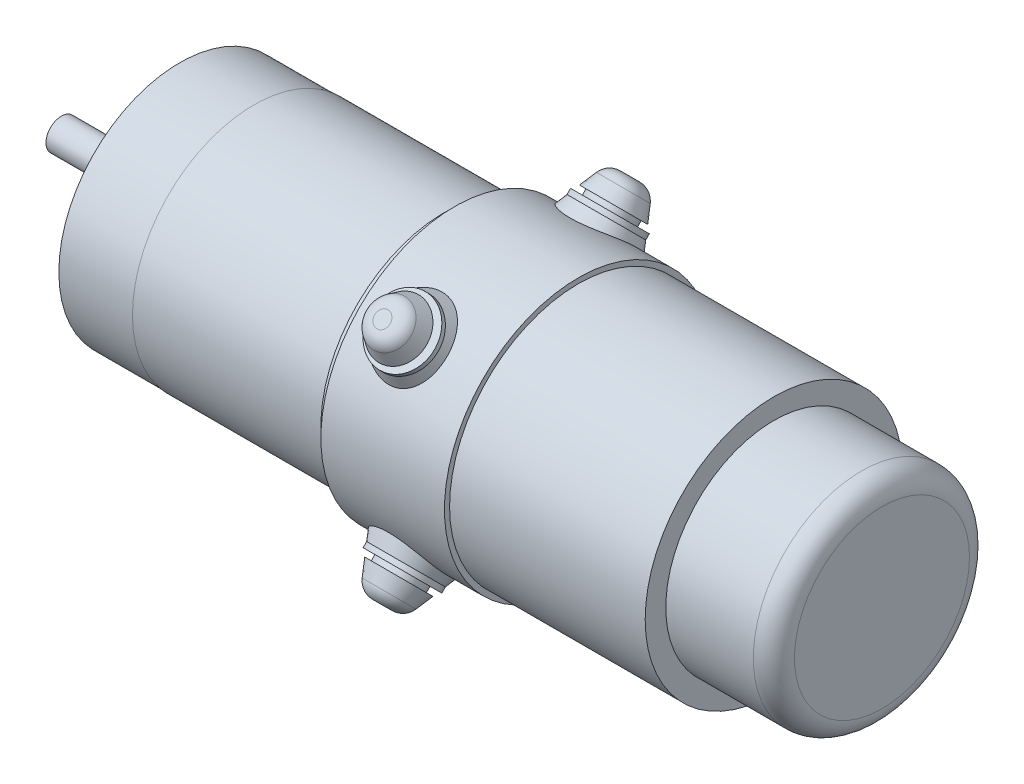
ISO-10303-21;
HEADER;
FILE_DESCRIPTION(('STEP AP214'),'2;1');
FILE_NAME('part.step','',(''),(''),'','','');
FILE_SCHEMA(('AUTOMOTIVE_DESIGN { 1 0 10303 214 1 1 1 1 }'));
ENDSEC;
DATA;
#1=APPLICATION_CONTEXT('core data for automotive mechanical design processes');
#2=APPLICATION_PROTOCOL_DEFINITION('international standard','automotive_design',2000,#1);
#3=PRODUCT_CONTEXT('',#1,'mechanical');
#4=PRODUCT('Part','Part','',(#3));
#5=PRODUCT_RELATED_PRODUCT_CATEGORY('part','',(#4));
#6=PRODUCT_DEFINITION_FORMATION('','',#4);
#7=PRODUCT_DEFINITION_CONTEXT('part definition',#1,'design');
#8=PRODUCT_DEFINITION('design','',#6,#7);
#9=PRODUCT_DEFINITION_SHAPE('','',#8);
#10=(LENGTH_UNIT() NAMED_UNIT(*) SI_UNIT(.MILLI.,.METRE.));
#11=(NAMED_UNIT(*) PLANE_ANGLE_UNIT() SI_UNIT($,.RADIAN.));
#12=(NAMED_UNIT(*) SI_UNIT($,.STERADIAN.) SOLID_ANGLE_UNIT());
#13=UNCERTAINTY_MEASURE_WITH_UNIT(LENGTH_MEASURE(1.E-05),#10,'distance_accuracy_value','');
#14=(GEOMETRIC_REPRESENTATION_CONTEXT(3) GLOBAL_UNCERTAINTY_ASSIGNED_CONTEXT((#13)) GLOBAL_UNIT_ASSIGNED_CONTEXT((#10,
#11,#12)) REPRESENTATION_CONTEXT('',''));
#15=CARTESIAN_POINT('',(0.,0.,0.));
#16=DIRECTION('',(0.,0.,1.));
#17=DIRECTION('',(1.,0.,0.));
#18=AXIS2_PLACEMENT_3D('',#15,#16,#17);
#19=CARTESIAN_POINT('',(-134.247535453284,21.,0.));
#20=DIRECTION('',(1.,0.,0.));
#21=DIRECTION('',(0.,0.,-1.));
#22=AXIS2_PLACEMENT_3D('',#19,#20,#21);
#23=PLANE('',#22);
#24=CARTESIAN_POINT('',(-134.247535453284,-12.7279220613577,12.7279220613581));
#25=DIRECTION('',(1.,0.,0.));
#26=DIRECTION('',(0.,0.,-1.));
#27=AXIS2_PLACEMENT_3D('',#24,#25,#26);
#28=CIRCLE('',#27,1.64999999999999);
#29=CARTESIAN_POINT('',(-134.247535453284,-12.7279220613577,11.0779220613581));
#30=VERTEX_POINT('',#29);
#31=EDGE_CURVE('E844',#30,#30,#28,.T.);
#32=ORIENTED_EDGE('',*,*,#31,.F.);
#33=EDGE_LOOP('',(#32));
#34=FACE_BOUND('',#33,.T.);
#35=CARTESIAN_POINT('',(-134.247535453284,-12.7279220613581,-12.7279220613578));
#36=DIRECTION('',(1.,0.,0.));
#37=DIRECTION('',(0.,0.,-1.));
#38=AXIS2_PLACEMENT_3D('',#35,#36,#37);
#39=CIRCLE('',#38,1.64999999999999);
#40=CARTESIAN_POINT('',(-134.247535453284,-12.7279220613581,-14.3779220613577));
#41=VERTEX_POINT('',#40);
#42=EDGE_CURVE('E854',#41,#41,#39,.T.);
#43=ORIENTED_EDGE('',*,*,#42,.F.);
#44=EDGE_LOOP('',(#43));
#45=FACE_BOUND('',#44,.T.);
#46=CARTESIAN_POINT('',(-134.247535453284,12.7279220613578,-12.727922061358));
#47=DIRECTION('',(1.,0.,0.));
#48=DIRECTION('',(0.,0.,-1.));
#49=AXIS2_PLACEMENT_3D('',#46,#47,#48);
#50=CIRCLE('',#49,1.64999999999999);
#51=CARTESIAN_POINT('',(-134.247535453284,12.7279220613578,-14.377922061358));
#52=VERTEX_POINT('',#51);
#53=EDGE_CURVE('E860',#52,#52,#50,.T.);
#54=ORIENTED_EDGE('',*,*,#53,.F.);
#55=EDGE_LOOP('',(#54));
#56=FACE_BOUND('',#55,.T.);
#57=CARTESIAN_POINT('',(-134.247535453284,12.727922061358,12.7279220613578));
#58=DIRECTION('',(1.,0.,0.));
#59=DIRECTION('',(0.,0.,-1.));
#60=AXIS2_PLACEMENT_3D('',#57,#58,#59);
#61=CIRCLE('',#60,1.64999999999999);
#62=CARTESIAN_POINT('',(-134.247535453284,12.727922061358,11.0779220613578));
#63=VERTEX_POINT('',#62);
#64=EDGE_CURVE('E37',#63,#63,#61,.T.);
#65=ORIENTED_EDGE('',*,*,#64,.F.);
#66=EDGE_LOOP('',(#65));
#67=FACE_BOUND('',#66,.T.);
#68=CARTESIAN_POINT('',(-134.247535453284,0.,0.));
#69=DIRECTION('',(1.,0.,0.));
#70=DIRECTION('',(0.,0.,-1.));
#71=AXIS2_PLACEMENT_3D('',#68,#69,#70);
#72=CIRCLE('',#71,21.);
#73=CARTESIAN_POINT('',(-134.247535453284,0.,-21.));
#74=VERTEX_POINT('',#73);
#75=EDGE_CURVE('E109',#74,#74,#72,.T.);
#76=ORIENTED_EDGE('',*,*,#75,.T.);
#77=EDGE_LOOP('',(#76));
#78=FACE_BOUND('',#77,.T.);
#79=ADVANCED_FACE('F33',(#34,#45,#56,#67,#78),#23,.T.);
#80=CARTESIAN_POINT('',(0.,0.,0.));
#81=DIRECTION('',(1.,0.,0.));
#82=DIRECTION('',(0.,0.,-1.));
#83=AXIS2_PLACEMENT_3D('',#80,#81,#82);
#84=CYLINDRICAL_SURFACE('',#83,21.);
#85=CARTESIAN_POINT('',(-24.6821426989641,0.,0.));
#86=DIRECTION('',(1.,0.,0.));
#87=DIRECTION('',(0.,0.,-1.));
#88=AXIS2_PLACEMENT_3D('',#85,#86,#87);
#89=CIRCLE('',#88,21.);
#90=CARTESIAN_POINT('',(-24.6821426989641,0.,-21.));
#91=VERTEX_POINT('',#90);
#92=EDGE_CURVE('E106',#91,#91,#89,.T.);
#93=ORIENTED_EDGE('',*,*,#92,.T.);
#94=EDGE_LOOP('',(#93));
#95=FACE_BOUND('',#94,.T.);
#96=ORIENTED_EDGE('',*,*,#75,.F.);
#97=EDGE_LOOP('',(#96));
#98=FACE_BOUND('',#97,.T.);
#99=ADVANCED_FACE('F199',(#95,#98),#84,.F.);
#100=CARTESIAN_POINT('',(-24.6821426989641,17.,0.));
#101=DIRECTION('',(-1.,0.,0.));
#102=DIRECTION('',(0.,0.,1.));
#103=AXIS2_PLACEMENT_3D('',#100,#101,#102);
#104=PLANE('',#103);
#105=CARTESIAN_POINT('',(-24.6821426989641,0.,0.));
#106=DIRECTION('',(1.,0.,0.));
#107=DIRECTION('',(0.,0.,-1.));
#108=AXIS2_PLACEMENT_3D('',#105,#106,#107);
#109=CIRCLE('',#108,17.);
#110=CARTESIAN_POINT('',(-24.6821426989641,0.,-17.));
#111=VERTEX_POINT('',#110);
#112=EDGE_CURVE('E103',#111,#111,#109,.T.);
#113=ORIENTED_EDGE('',*,*,#112,.T.);
#114=EDGE_LOOP('',(#113));
#115=FACE_BOUND('',#114,.T.);
#116=ORIENTED_EDGE('',*,*,#92,.F.);
#117=EDGE_LOOP('',(#116));
#118=FACE_BOUND('',#117,.T.);
#119=ADVANCED_FACE('F195',(#115,#118),#104,.T.);
#120=CARTESIAN_POINT('',(0.,0.,0.));
#121=DIRECTION('',(1.,0.,0.));
#122=DIRECTION('',(0.,0.,-1.));
#123=AXIS2_PLACEMENT_3D('',#120,#121,#122);
#124=CYLINDRICAL_SURFACE('',#123,17.);
#125=CARTESIAN_POINT('',(-4.22993605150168,0.,0.));
#126=DIRECTION('',(1.,0.,0.));
#127=DIRECTION('',(0.,0.,-1.));
#128=AXIS2_PLACEMENT_3D('',#125,#126,#127);
#129=CIRCLE('',#128,17.);
#130=CARTESIAN_POINT('',(-4.22993605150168,0.,-17.));
#131=VERTEX_POINT('',#130);
#132=EDGE_CURVE('E100',#131,#131,#129,.T.);
#133=ORIENTED_EDGE('',*,*,#132,.T.);
#134=EDGE_LOOP('',(#133));
#135=FACE_BOUND('',#134,.T.);
#136=ORIENTED_EDGE('',*,*,#112,.F.);
#137=EDGE_LOOP('',(#136));
#138=FACE_BOUND('',#137,.T.);
#139=ADVANCED_FACE('F191',(#135,#138),#124,.F.);
#140=CARTESIAN_POINT('',(-4.22993605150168,0.,0.));
#141=DIRECTION('',(-1.,0.,0.));
#142=DIRECTION('',(0.,0.,1.));
#143=AXIS2_PLACEMENT_3D('',#140,#141,#142);
#144=PLANE('',#143);
#145=ORIENTED_EDGE('',*,*,#132,.F.);
#146=EDGE_LOOP('',(#145));
#147=FACE_BOUND('',#146,.T.);
#148=ADVANCED_FACE('F187',(#147),#144,.T.);
#149=CARTESIAN_POINT('',(-136.4,12.727922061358,12.7279220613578));
#150=DIRECTION('',(-1.,0.,0.));
#151=DIRECTION('',(0.,0.,1.));
#152=AXIS2_PLACEMENT_3D('',#149,#150,#151);
#153=CYLINDRICAL_SURFACE('',#152,1.64999999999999);
#154=ORIENTED_EDGE('',*,*,#64,.T.);
#155=EDGE_LOOP('',(#154));
#156=FACE_BOUND('',#155,.T.);
#157=CARTESIAN_POINT('',(-136.4,12.727922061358,12.7279220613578));
#158=DIRECTION('',(-1.,0.,0.));
#159=DIRECTION('',(0.,0.,1.));
#160=AXIS2_PLACEMENT_3D('',#157,#158,#159);
#161=CIRCLE('',#160,1.64999999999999);
#162=CARTESIAN_POINT('',(-136.4,12.727922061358,14.3779220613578));
#163=VERTEX_POINT('',#162);
#164=EDGE_CURVE('E862',#163,#163,#161,.T.);
#165=ORIENTED_EDGE('',*,*,#164,.T.);
#166=EDGE_LOOP('',(#165));
#167=FACE_BOUND('',#166,.T.);
#168=ADVANCED_FACE('F190',(#156,#167),#153,.F.);
#169=CARTESIAN_POINT('',(0.,0.,0.));
#170=DIRECTION('',(1.,0.,0.));
#171=DIRECTION('',(0.,0.,-1.));
#172=AXIS2_PLACEMENT_3D('',#169,#170,#171);
#173=PLANE('',#172);
#174=CARTESIAN_POINT('',(0.,0.,0.));
#175=DIRECTION('',(1.,0.,0.));
#176=DIRECTION('',(0.,0.,-1.));
#177=AXIS2_PLACEMENT_3D('',#174,#175,#176);
#178=CIRCLE('',#177,17.);
#179=CARTESIAN_POINT('',(0.,0.,-17.));
#180=VERTEX_POINT('',#179);
#181=EDGE_CURVE('E160',#180,#180,#178,.T.);
#182=ORIENTED_EDGE('',*,*,#181,.T.);
#183=EDGE_LOOP('',(#182));
#184=FACE_BOUND('',#183,.T.);
#185=ADVANCED_FACE('F35',(#184),#173,.T.);
#186=CARTESIAN_POINT('',(-4.,0.,0.));
#187=DIRECTION('',(1.,0.,0.));
#188=DIRECTION('',(0.,0.,-1.));
#189=AXIS2_PLACEMENT_3D('',#186,#187,#188);
#190=TOROIDAL_SURFACE('',#189,17.,4.);
#191=CARTESIAN_POINT('',(-4.,0.,0.));
#192=DIRECTION('',(1.,0.,0.));
#193=DIRECTION('',(0.,0.,-1.));
#194=AXIS2_PLACEMENT_3D('',#191,#192,#193);
#195=CIRCLE('',#194,21.);
#196=CARTESIAN_POINT('',(-4.,0.,-21.));
#197=VERTEX_POINT('',#196);
#198=EDGE_CURVE('E157',#197,#197,#195,.T.);
#199=ORIENTED_EDGE('',*,*,#198,.T.);
#200=EDGE_LOOP('',(#199));
#201=FACE_BOUND('',#200,.T.);
#202=ORIENTED_EDGE('',*,*,#181,.F.);
#203=EDGE_LOOP('',(#202));
#204=FACE_BOUND('',#203,.T.);
#205=ADVANCED_FACE('F279',(#201,#204),#190,.T.);
#206=CARTESIAN_POINT('',(0.,0.,0.));
#207=DIRECTION('',(1.,0.,0.));
#208=DIRECTION('',(0.,0.,-1.));
#209=AXIS2_PLACEMENT_3D('',#206,#207,#208);
#210=CYLINDRICAL_SURFACE('',#209,21.);
#211=CARTESIAN_POINT('',(-21.,0.,0.));
#212=DIRECTION('',(1.,0.,0.));
#213=DIRECTION('',(0.,0.,-1.));
#214=AXIS2_PLACEMENT_3D('',#211,#212,#213);
#215=CIRCLE('',#214,21.);
#216=CARTESIAN_POINT('',(-21.,0.,-21.));
#217=VERTEX_POINT('',#216);
#218=EDGE_CURVE('E154',#217,#217,#215,.T.);
#219=ORIENTED_EDGE('',*,*,#218,.T.);
#220=EDGE_LOOP('',(#219));
#221=FACE_BOUND('',#220,.T.);
#222=ORIENTED_EDGE('',*,*,#198,.F.);
#223=EDGE_LOOP('',(#222));
#224=FACE_BOUND('',#223,.T.);
#225=ADVANCED_FACE('F273',(#221,#224),#210,.T.);
#226=CARTESIAN_POINT('',(-21.,21.,0.));
#227=DIRECTION('',(1.,0.,0.));
#228=DIRECTION('',(0.,0.,-1.));
#229=AXIS2_PLACEMENT_3D('',#226,#227,#228);
#230=PLANE('',#229);
#231=CARTESIAN_POINT('',(-21.,0.,0.));
#232=DIRECTION('',(1.,0.,0.));
#233=DIRECTION('',(0.,0.,-1.));
#234=AXIS2_PLACEMENT_3D('',#231,#232,#233);
#235=CIRCLE('',#234,25.);
#236=CARTESIAN_POINT('',(-21.,0.,-25.));
#237=VERTEX_POINT('',#236);
#238=EDGE_CURVE('E151',#237,#237,#235,.T.);
#239=ORIENTED_EDGE('',*,*,#238,.T.);
#240=EDGE_LOOP('',(#239));
#241=FACE_BOUND('',#240,.T.);
#242=ORIENTED_EDGE('',*,*,#218,.F.);
#243=EDGE_LOOP('',(#242));
#244=FACE_BOUND('',#243,.T.);
#245=ADVANCED_FACE('F267',(#241,#244),#230,.T.);
#246=CARTESIAN_POINT('',(0.,0.,0.));
#247=DIRECTION('',(1.,0.,0.));
#248=DIRECTION('',(0.,0.,-1.));
#249=AXIS2_PLACEMENT_3D('',#246,#247,#248);
#250=CYLINDRICAL_SURFACE('',#249,25.);
#251=CARTESIAN_POINT('',(-59.,0.,0.));
#252=DIRECTION('',(1.,0.,0.));
#253=DIRECTION('',(0.,0.,-1.));
#254=AXIS2_PLACEMENT_3D('',#251,#252,#253);
#255=CIRCLE('',#254,25.);
#256=CARTESIAN_POINT('',(-59.,0.,-25.));
#257=VERTEX_POINT('',#256);
#258=EDGE_CURVE('E148',#257,#257,#255,.T.);
#259=ORIENTED_EDGE('',*,*,#258,.T.);
#260=EDGE_LOOP('',(#259));
#261=FACE_BOUND('',#260,.T.);
#262=ORIENTED_EDGE('',*,*,#238,.F.);
#263=EDGE_LOOP('',(#262));
#264=FACE_BOUND('',#263,.T.);
#265=ADVANCED_FACE('F262',(#261,#264),#250,.T.);
#266=CARTESIAN_POINT('',(-59.,25.,0.));
#267=DIRECTION('',(1.,0.,0.));
#268=DIRECTION('',(0.,0.,-1.));
#269=AXIS2_PLACEMENT_3D('',#266,#267,#268);
#270=PLANE('',#269);
#271=CARTESIAN_POINT('',(-59.,0.,0.));
#272=DIRECTION('',(1.,0.,0.));
#273=DIRECTION('',(0.,0.,-1.));
#274=AXIS2_PLACEMENT_3D('',#271,#272,#273);
#275=CIRCLE('',#274,26.);
#276=CARTESIAN_POINT('',(-59.,0.,-26.));
#277=VERTEX_POINT('',#276);
#278=EDGE_CURVE('E145',#277,#277,#275,.T.);
#279=ORIENTED_EDGE('',*,*,#278,.T.);
#280=EDGE_LOOP('',(#279));
#281=FACE_BOUND('',#280,.T.);
#282=ORIENTED_EDGE('',*,*,#258,.F.);
#283=EDGE_LOOP('',(#282));
#284=FACE_BOUND('',#283,.T.);
#285=ADVANCED_FACE('F251',(#281,#284),#270,.T.);
#286=CARTESIAN_POINT('',(0.,0.,0.));
#287=DIRECTION('',(1.,0.,0.));
#288=DIRECTION('',(0.,0.,-1.));
#289=AXIS2_PLACEMENT_3D('',#286,#287,#288);
#290=CYLINDRICAL_SURFACE('',#289,26.);
#291=CARTESIAN_POINT('',(-77.3574954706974,-21.9597816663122,13.9200570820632));
#292=CARTESIAN_POINT('',(-77.1933845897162,-22.0381991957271,13.7963506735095));
#293=CARTESIAN_POINT('',(-77.0226445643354,-22.1115435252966,13.6783308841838));
#294=CARTESIAN_POINT('',(-76.6689547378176,-22.247910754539,13.4553901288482));
#295=CARTESIAN_POINT('',(-76.4860090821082,-22.3109371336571,13.3504647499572));
#296=CARTESIAN_POINT('',(-76.1091636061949,-22.4264728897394,13.1554618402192));
#297=CARTESIAN_POINT('',(-75.9152621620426,-22.4789807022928,13.0653865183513));
#298=CARTESIAN_POINT('',(-75.5180913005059,-22.5732574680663,12.901820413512));
#299=CARTESIAN_POINT('',(-75.3148237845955,-22.6150285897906,12.8283262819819));
#300=CARTESIAN_POINT('',(-74.9261516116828,-22.6831904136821,12.7073632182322));
#301=CARTESIAN_POINT('',(-74.7416140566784,-22.7108391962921,12.6578078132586));
#302=CARTESIAN_POINT('',(-74.368135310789,-22.7576179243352,12.5735101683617));
#303=CARTESIAN_POINT('',(-74.1791946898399,-22.7767489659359,12.5387660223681));
#304=CARTESIAN_POINT('',(-73.7985922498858,-22.8063974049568,12.484758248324));
#305=CARTESIAN_POINT('',(-73.606932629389,-22.8169213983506,12.4654827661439));
#306=CARTESIAN_POINT('',(-73.2224011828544,-22.8293293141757,12.4427447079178));
#307=CARTESIAN_POINT('',(-73.0295294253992,-22.8312137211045,12.4392812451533));
#308=CARTESIAN_POINT('',(-72.6609368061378,-22.8265463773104,12.447842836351));
#309=CARTESIAN_POINT('',(-72.4851745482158,-22.8207097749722,12.4585549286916));
#310=CARTESIAN_POINT('',(-72.1352696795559,-22.8018415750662,12.4930544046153));
#311=CARTESIAN_POINT('',(-71.9611276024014,-22.7888076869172,12.5168459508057));
#312=CARTESIAN_POINT('',(-71.6158108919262,-22.7555996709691,12.5771166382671));
#313=CARTESIAN_POINT('',(-71.4446352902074,-22.7354279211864,12.6135915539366));
#314=CARTESIAN_POINT('',(-71.1062694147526,-22.6880089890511,12.6986856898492));
#315=CARTESIAN_POINT('',(-70.9390806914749,-22.6607591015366,12.7473095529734));
#316=CARTESIAN_POINT('',(-70.6096457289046,-22.5992477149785,12.8560453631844));
#317=CARTESIAN_POINT('',(-70.4474037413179,-22.5649803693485,12.9161668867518));
#318=CARTESIAN_POINT('',(-70.1289093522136,-22.4895498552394,13.0470630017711));
#319=CARTESIAN_POINT('',(-69.972659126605,-22.448384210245,13.1178414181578));
#320=CARTESIAN_POINT('',(-69.5142131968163,-22.3146934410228,13.3448602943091));
#321=CARTESIAN_POINT('',(-69.2220952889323,-22.2119323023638,13.5158607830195));
#322=CARTESIAN_POINT('',(-68.6487707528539,-21.9709337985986,13.9044717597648));
#323=CARTESIAN_POINT('',(-68.3702797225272,-21.8305249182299,14.1247076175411));
#324=CARTESIAN_POINT('',(-67.856353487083,-21.5201488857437,14.5932150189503));
#325=CARTESIAN_POINT('',(-67.6209350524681,-21.3501702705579,14.8414974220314));
#326=CARTESIAN_POINT('',(-67.2949698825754,-21.0670656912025,15.2383784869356));
#327=CARTESIAN_POINT('',(-67.1875441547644,-20.9636819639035,15.3803895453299));
#328=CARTESIAN_POINT('',(-66.9870906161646,-20.7491377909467,15.6686147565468));
#329=CARTESIAN_POINT('',(-66.8940585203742,-20.6379796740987,15.8148276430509));
#330=CARTESIAN_POINT('',(-66.7228669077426,-20.4082363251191,16.1102119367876));
#331=CARTESIAN_POINT('',(-66.6447142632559,-20.2896476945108,16.259384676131));
#332=CARTESIAN_POINT('',(-66.5038022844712,-20.0456255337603,16.5592949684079));
#333=CARTESIAN_POINT('',(-66.4410373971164,-19.9201944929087,16.7100319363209));
#334=CARTESIAN_POINT('',(-66.3297576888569,-19.6595537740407,17.0159751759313));
#335=CARTESIAN_POINT('',(-66.2816757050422,-19.5241711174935,17.1711917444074));
#336=CARTESIAN_POINT('',(-66.2024396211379,-19.2475348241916,17.480717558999));
#337=CARTESIAN_POINT('',(-66.1712858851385,-19.1062810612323,17.6350267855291));
#338=CARTESIAN_POINT('',(-66.1261241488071,-18.8187954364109,17.9414903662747));
#339=CARTESIAN_POINT('',(-66.1121153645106,-18.6725638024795,18.0936448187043));
#340=CARTESIAN_POINT('',(-66.1013401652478,-18.3761166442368,18.3946447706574));
#341=CARTESIAN_POINT('',(-66.1045735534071,-18.2259011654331,18.5434903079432));
#342=CARTESIAN_POINT('',(-66.1281706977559,-17.9237185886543,18.8357150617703));
#343=CARTESIAN_POINT('',(-66.1484066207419,-17.7717728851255,18.9791267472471));
#344=CARTESIAN_POINT('',(-66.2057012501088,-17.4662057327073,19.260706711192));
#345=CARTESIAN_POINT('',(-66.2427599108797,-17.3125842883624,19.398875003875));
#346=CARTESIAN_POINT('',(-66.3334441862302,-17.0049199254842,19.6691285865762));
#347=CARTESIAN_POINT('',(-66.3870676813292,-16.8508770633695,19.8012146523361));
#348=CARTESIAN_POINT('',(-66.5105579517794,-16.5435826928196,20.0586656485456));
#349=CARTESIAN_POINT('',(-66.5804308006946,-16.3903315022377,20.1840280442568));
#350=CARTESIAN_POINT('',(-66.7361445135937,-16.0856834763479,20.4276507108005));
#351=CARTESIAN_POINT('',(-66.822019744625,-15.9342913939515,20.5458949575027));
#352=CARTESIAN_POINT('',(-67.0091644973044,-15.6350271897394,20.7745373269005));
#353=CARTESIAN_POINT('',(-67.1104398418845,-15.487156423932,20.8849324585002));
#354=CARTESIAN_POINT('',(-67.3277914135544,-15.1964080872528,21.0974313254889));
#355=CARTESIAN_POINT('',(-67.4438680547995,-15.0535306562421,21.1995348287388));
#356=CARTESIAN_POINT('',(-67.6901837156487,-14.7742300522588,21.39512083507));
#357=CARTESIAN_POINT('',(-67.8204224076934,-14.6378067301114,21.4886035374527));
#358=CARTESIAN_POINT('',(-68.094840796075,-14.372440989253,21.6669931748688));
#359=CARTESIAN_POINT('',(-68.239067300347,-14.2435261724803,21.7518692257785));
#360=CARTESIAN_POINT('',(-68.5402109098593,-13.9953009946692,21.9124026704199));
#361=CARTESIAN_POINT('',(-68.6971213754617,-13.8759856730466,21.9880648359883));
#362=CARTESIAN_POINT('',(-69.0228527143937,-13.6484194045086,22.1300394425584));
#363=CARTESIAN_POINT('',(-69.1916774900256,-13.5401721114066,22.1963487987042));
#364=CARTESIAN_POINT('',(-69.5400622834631,-13.3364228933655,22.3193634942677));
#365=CARTESIAN_POINT('',(-69.7196166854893,-13.2409143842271,22.3760737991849));
#366=CARTESIAN_POINT('',(-70.0793956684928,-13.0684084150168,22.4772377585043));
#367=CARTESIAN_POINT('',(-70.2591689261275,-12.9907396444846,22.5221511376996));
#368=CARTESIAN_POINT('',(-70.6260713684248,-12.8496002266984,22.6029730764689));
#369=CARTESIAN_POINT('',(-70.8131968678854,-12.7861225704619,22.638886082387));
#370=CARTESIAN_POINT('',(-71.193362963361,-12.6744827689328,22.7015768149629));
#371=CARTESIAN_POINT('',(-71.3864007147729,-12.6263133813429,22.7283588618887));
#372=CARTESIAN_POINT('',(-71.7768503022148,-12.546185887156,22.7726881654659));
#373=CARTESIAN_POINT('',(-71.974261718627,-12.514226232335,22.7902363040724));
#374=CARTESIAN_POINT('',(-72.3530901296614,-12.4693670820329,22.8148080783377));
#375=CARTESIAN_POINT('',(-72.5342770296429,-12.4549650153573,22.8226622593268));
#376=CARTESIAN_POINT('',(-72.8973886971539,-12.4402613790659,22.8306804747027));
#377=CARTESIAN_POINT('',(-73.0793134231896,-12.4399590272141,22.8308449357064));
#378=CARTESIAN_POINT('',(-73.4424443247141,-12.45345855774,22.8234841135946));
#379=CARTESIAN_POINT('',(-73.6236506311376,-12.4672577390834,22.8159603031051));
#380=CARTESIAN_POINT('',(-73.9839833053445,-12.5087150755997,22.7932578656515));
#381=CARTESIAN_POINT('',(-74.1631096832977,-12.5363731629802,22.7780792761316));
#382=CARTESIAN_POINT('',(-74.5103231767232,-12.6036017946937,22.7409460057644));
#383=CARTESIAN_POINT('',(-74.6785539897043,-12.6426096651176,22.719310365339));
#384=CARTESIAN_POINT('',(-75.0108689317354,-12.7323255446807,22.6691536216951));
#385=CARTESIAN_POINT('',(-75.1749516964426,-12.7830373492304,22.6406302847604));
#386=CARTESIAN_POINT('',(-75.4979119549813,-12.895445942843,22.5767944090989));
#387=CARTESIAN_POINT('',(-75.6567905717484,-12.957140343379,22.5414833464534));
#388=CARTESIAN_POINT('',(-75.9685394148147,-13.090728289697,22.4641667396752));
#389=CARTESIAN_POINT('',(-76.1214074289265,-13.1626255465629,22.4221587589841));
#390=CARTESIAN_POINT('',(-76.585379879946,-13.4003561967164,22.2815062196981));
#391=CARTESIAN_POINT('',(-76.8850253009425,-13.5823255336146,22.1715014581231));
#392=CARTESIAN_POINT('',(-77.4483553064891,-13.9795284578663,21.9232170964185));
#393=CARTESIAN_POINT('',(-77.7120259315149,-14.1947748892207,21.7849265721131));
#394=CARTESIAN_POINT('',(-78.0881004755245,-14.5465369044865,21.5504204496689));
#395=CARTESIAN_POINT('',(-78.2147892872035,-14.6743730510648,21.4636478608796));
#396=CARTESIAN_POINT('',(-78.4555542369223,-14.9361948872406,21.2822790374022));
#397=CARTESIAN_POINT('',(-78.5696338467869,-15.070178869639,21.1876849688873));
#398=CARTESIAN_POINT('',(-78.7846878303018,-15.3431245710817,20.9908756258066));
#399=CARTESIAN_POINT('',(-78.8856547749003,-15.4820890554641,20.8886560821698));
#400=CARTESIAN_POINT('',(-79.0738776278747,-15.7636590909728,20.6769934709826));
#401=CARTESIAN_POINT('',(-79.1611380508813,-15.9062634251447,20.5675527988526));
#402=CARTESIAN_POINT('',(-79.3258042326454,-16.2016319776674,20.3357862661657));
#403=CARTESIAN_POINT('',(-79.4024373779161,-16.3545327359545,20.2130845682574));
#404=CARTESIAN_POINT('',(-79.5395348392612,-16.6616811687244,19.9606583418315));
#405=CARTESIAN_POINT('',(-79.6000045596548,-16.8159283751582,19.8309361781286));
#406=CARTESIAN_POINT('',(-79.7044400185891,-17.12455425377,19.5650488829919));
#407=CARTESIAN_POINT('',(-79.7484003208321,-17.2789329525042,19.428881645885));
#408=CARTESIAN_POINT('',(-79.8194808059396,-17.5864421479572,19.1509786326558));
#409=CARTESIAN_POINT('',(-79.8466074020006,-17.739573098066,19.0092449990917));
#410=CARTESIAN_POINT('',(-79.8838918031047,-18.0437032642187,18.720811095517));
#411=CARTESIAN_POINT('',(-79.8940205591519,-18.1946983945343,18.574102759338));
#412=CARTESIAN_POINT('',(-79.8971480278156,-18.4931616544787,18.2769613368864));
#413=CARTESIAN_POINT('',(-79.8901466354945,-18.6406297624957,18.1265282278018));
#414=CARTESIAN_POINT('',(-79.8590606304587,-18.9310278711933,17.8230273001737));
#415=CARTESIAN_POINT('',(-79.8349734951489,-19.0739571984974,17.6699590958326));
#416=CARTESIAN_POINT('',(-79.7698809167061,-19.3543307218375,17.3624071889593));
#417=CARTESIAN_POINT('',(-79.7288756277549,-19.4917749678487,17.2079234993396));
#418=CARTESIAN_POINT('',(-79.630466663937,-19.7597113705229,16.8995657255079));
#419=CARTESIAN_POINT('',(-79.5731447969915,-19.8902344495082,16.7456923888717));
#420=CARTESIAN_POINT('',(-79.4423674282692,-20.14442409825,16.4390347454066));
#421=CARTESIAN_POINT('',(-79.3689055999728,-20.2680879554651,16.286250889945));
#422=CARTESIAN_POINT('',(-79.2063760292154,-20.5078361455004,15.9833015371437));
#423=CARTESIAN_POINT('',(-79.1173221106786,-20.6239270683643,15.833133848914));
#424=CARTESIAN_POINT('',(-78.9240869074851,-20.8481923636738,15.5366495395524));
#425=CARTESIAN_POINT('',(-78.8199020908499,-20.9563648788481,15.3903338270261));
#426=CARTESIAN_POINT('',(-78.5220040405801,-21.2343436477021,15.0063461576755));
#427=CARTESIAN_POINT('',(-78.3151597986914,-21.3967455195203,14.7733230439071));
#428=CARTESIAN_POINT('',(-77.8636647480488,-21.6969936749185,14.3287325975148));
#429=CARTESIAN_POINT('',(-77.6189959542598,-21.8348282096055,14.1171755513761));
#430=CARTESIAN_POINT('',(-77.3574954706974,-21.9597816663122,13.9200570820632));
#431=B_SPLINE_CURVE_WITH_KNOTS('',3,(#291,#292,#293,#294,#295,#296,#297,#298,#299,#300,#301,
#302,#303,#304,#305,#306,#307,#308,#309,#310,#311,#312,#313,#314,#315,#316,#317,#318,#319,#320,
#321,#322,#323,#324,#325,#326,#327,#328,#329,#330,#331,#332,#333,#334,#335,#336,#337,#338,#339,
#340,#341,#342,#343,#344,#345,#346,#347,#348,#349,#350,#351,#352,#353,#354,#355,#356,#357,#358,
#359,#360,#361,#362,#363,#364,#365,#366,#367,#368,#369,#370,#371,#372,#373,#374,#375,#376,#377,
#378,#379,#380,#381,#382,#383,#384,#385,#386,#387,#388,#389,#390,#391,#392,#393,#394,#395,#396,
#397,#398,#399,#400,#401,#402,#403,#404,#405,#406,#407,#408,#409,#410,#411,#412,#413,#414,#415,
#416,#417,#418,#419,#420,#421,#422,#423,#424,#425,#426,#427,#428,#429,#430),.UNSPECIFIED.,.T.,
.F.,(4,2,2,2,2,2,2,2,2,2,2,2,2,2,2,2,2,2,2,2,2,2,2,2,2,2,2,2,2,2,2,2,2,2,2,2,2,2,2,2,2,2,2,2,2,
2,2,2,2,2,2,2,2,2,2,2,2,2,2,2,2,2,2,2,2,2,2,2,2,4),(0.,0.65954939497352,1.31887591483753,
1.97830042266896,2.63759164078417,3.21601617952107,3.7943662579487,4.37227270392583,
4.95014674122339,5.47806885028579,6.00615907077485,6.53407352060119,7.06219002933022,
7.59074834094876,8.11949681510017,9.17627235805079,10.3170964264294,11.4583637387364,
12.0754864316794,12.692425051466,13.3096479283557,13.9266477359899,14.5603879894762,
15.1941418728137,15.8278667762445,16.461584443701,17.0905797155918,17.7195732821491,
18.3484864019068,18.9776349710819,19.608150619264,20.2389052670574,20.8696775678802,
21.5004352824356,22.1333817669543,22.7659990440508,23.3988244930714,24.0313215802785,
24.6332664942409,25.234913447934,25.8362753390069,26.4375797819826,26.9826693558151,
27.5277286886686,28.072683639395,28.6176359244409,29.1391820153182,29.6608974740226,
30.1824996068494,30.7042919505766,31.8016596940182,32.899452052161,33.498306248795,
34.0969951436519,34.696021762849,35.2948506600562,35.9255803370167,36.556098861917,
37.1868248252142,37.8173103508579,38.4488722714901,39.0804380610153,39.7120971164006,
40.3437504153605,40.9722908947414,41.6010781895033,42.2293107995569,42.8576902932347,
43.9081402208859,44.9590911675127),.UNSPECIFIED.);
#432=CARTESIAN_POINT('',(-77.3574954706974,-21.9597816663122,13.9200570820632));
#433=VERTEX_POINT('',#432);
#434=EDGE_CURVE('E376',#433,#433,#431,.T.);
#435=ORIENTED_EDGE('',*,*,#434,.F.);
#436=EDGE_LOOP('',(#435));
#437=FACE_BOUND('',#436,.T.);
#438=CARTESIAN_POINT('',(-77.3577759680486,-13.9202685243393,-21.9596476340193));
#439=CARTESIAN_POINT('',(-77.1936733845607,-13.7965562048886,-22.0380705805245));
#440=CARTESIAN_POINT('',(-77.0229414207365,-13.6785299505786,-22.1114204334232));
#441=CARTESIAN_POINT('',(-76.6692671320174,-13.4555751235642,-22.2477989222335));
#442=CARTESIAN_POINT('',(-76.4863289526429,-13.3506421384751,-22.3108310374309));
#443=CARTESIAN_POINT('',(-76.1094976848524,-13.1556228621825,-22.4263784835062));
#444=CARTESIAN_POINT('',(-75.9156029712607,-13.0655387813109,-22.4788922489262));
#445=CARTESIAN_POINT('',(-75.5184446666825,-12.9019540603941,-22.573181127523));
#446=CARTESIAN_POINT('',(-75.3151829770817,-12.8284500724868,-22.6149584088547));
#447=CARTESIAN_POINT('',(-74.9265170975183,-12.7074664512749,-22.6831326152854));
#448=CARTESIAN_POINT('',(-74.7419800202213,-12.6579007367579,-22.7107874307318));
#449=CARTESIAN_POINT('',(-74.3685011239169,-12.5735824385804,-22.7575780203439));
#450=CARTESIAN_POINT('',(-74.1795598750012,-12.5388279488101,-22.7767148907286));
#451=CARTESIAN_POINT('',(-73.7989550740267,-12.4847996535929,-22.8063747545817));
#452=CARTESIAN_POINT('',(-73.6072937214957,-12.4655139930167,-22.8169043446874));
#453=CARTESIAN_POINT('',(-73.2227577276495,-12.4427559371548,-22.8293232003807));
#454=CARTESIAN_POINT('',(-73.0298831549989,-12.439282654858,-22.8312129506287));
#455=CARTESIAN_POINT('',(-72.6612854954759,-12.4478259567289,-22.8265555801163));
#456=CARTESIAN_POINT('',(-72.4855210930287,-12.4585294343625,-22.8207236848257));
#457=CARTESIAN_POINT('',(-72.1356111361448,-12.4930120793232,-22.8018647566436));
#458=CARTESIAN_POINT('',(-71.9614661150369,-12.5167954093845,-22.7888354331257));
#459=CARTESIAN_POINT('',(-71.6161428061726,-12.57705018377,-22.7556363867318));
#460=CARTESIAN_POINT('',(-71.4449635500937,-12.6135174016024,-22.7354690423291));
#461=CARTESIAN_POINT('',(-71.1065897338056,-12.6985967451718,-22.688058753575));
#462=CARTESIAN_POINT('',(-70.9393967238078,-12.7472135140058,-22.6608131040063));
#463=CARTESIAN_POINT('',(-70.6099553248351,-12.8559349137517,-22.5993105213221));
#464=CARTESIAN_POINT('',(-70.4477111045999,-12.916048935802,-22.565047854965));
#465=CARTESIAN_POINT('',(-70.1292116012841,-13.0469304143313,-22.4896267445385));
#466=CARTESIAN_POINT('',(-69.9729584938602,-13.1177016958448,-22.4484658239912));
#467=CARTESIAN_POINT('',(-69.5145030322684,-13.3446998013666,-22.314789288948));
#468=CARTESIAN_POINT('',(-69.2223775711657,-13.5156872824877,-22.2120377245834));
#469=CARTESIAN_POINT('',(-68.6490371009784,-13.9042719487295,-21.9710600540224));
#470=CARTESIAN_POINT('',(-68.3705372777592,-14.1244944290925,-21.830662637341));
#471=CARTESIAN_POINT('',(-67.8565907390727,-14.5929771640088,-21.5203099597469));
#472=CARTESIAN_POINT('',(-67.6211607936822,-14.8412482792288,-21.3503432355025));
#473=CARTESIAN_POINT('',(-67.2951752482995,-15.2381145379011,-21.0672565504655));
#474=CARTESIAN_POINT('',(-67.1877416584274,-15.3801212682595,-20.9638787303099));
#475=CARTESIAN_POINT('',(-66.9872717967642,-15.6683385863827,-20.7493462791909));
#476=CARTESIAN_POINT('',(-66.8942312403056,-15.814547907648,-20.6381939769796));
#477=CARTESIAN_POINT('',(-66.7230221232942,-16.1099258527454,-20.4084621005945));
#478=CARTESIAN_POINT('',(-66.644860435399,-16.2590958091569,-20.2898791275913));
#479=CARTESIAN_POINT('',(-66.5039298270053,-16.5590013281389,-20.0458680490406));
#480=CARTESIAN_POINT('',(-66.4411553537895,-16.7097363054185,-19.9204424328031));
#481=CARTESIAN_POINT('',(-66.3298552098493,-17.0156776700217,-19.659811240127));
#482=CARTESIAN_POINT('',(-66.2817625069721,-17.1708943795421,-19.5244326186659));
#483=CARTESIAN_POINT('',(-66.2025048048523,-17.4804212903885,-19.2478038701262));
#484=CARTESIAN_POINT('',(-66.1713401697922,-17.6347314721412,-19.1065536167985));
#485=CARTESIAN_POINT('',(-66.1261565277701,-17.9411977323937,-18.819074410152));
#486=CARTESIAN_POINT('',(-66.1121367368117,-18.0933539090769,-18.6728456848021));
#487=CARTESIAN_POINT('',(-66.1013394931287,-18.3943580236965,-18.3764036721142));
#488=CARTESIAN_POINT('',(-66.1045618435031,-18.5432059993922,-18.2261904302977));
#489=CARTESIAN_POINT('',(-66.1281370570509,-18.8354364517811,-17.9240113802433));
#490=CARTESIAN_POINT('',(-66.1483621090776,-18.9788513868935,-17.7720669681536));
#491=CARTESIAN_POINT('',(-66.2056351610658,-19.2604384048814,-17.4665016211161));
#492=CARTESIAN_POINT('',(-66.2426831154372,-19.398610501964,-17.3128806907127));
#493=CARTESIAN_POINT('',(-66.3333462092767,-19.6688721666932,-17.0052165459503));
#494=CARTESIAN_POINT('',(-66.3869592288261,-19.8009625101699,-16.8511733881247));
#495=CARTESIAN_POINT('',(-66.5104288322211,-20.0584224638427,-16.543877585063));
#496=CARTESIAN_POINT('',(-66.5802914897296,-20.1837895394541,-16.3906252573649));
#497=CARTESIAN_POINT('',(-66.7359849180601,-20.4274215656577,-16.0859745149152));
#498=CARTESIAN_POINT('',(-66.8218500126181,-20.5456705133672,-15.9345808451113));
#499=CARTESIAN_POINT('',(-67.0089747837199,-20.7743225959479,-15.6353125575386));
#500=CARTESIAN_POINT('',(-67.110240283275,-20.8847227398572,-15.4874392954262));
#501=CARTESIAN_POINT('',(-67.3275725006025,-21.0972318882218,-15.1966850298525));
#502=CARTESIAN_POINT('',(-67.4436396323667,-21.1993406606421,-15.0538041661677));
#503=CARTESIAN_POINT('',(-67.6899366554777,-21.3949374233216,-14.7744957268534));
#504=CARTESIAN_POINT('',(-67.8201662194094,-21.488425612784,-14.6380680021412));
#505=CARTESIAN_POINT('',(-68.0945673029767,-21.6668267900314,-14.3726919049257));
#506=CARTESIAN_POINT('',(-68.2387856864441,-21.7517088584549,-14.2437711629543));
#507=CARTESIAN_POINT('',(-68.5399136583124,-21.9122544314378,-13.9955331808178));
#508=CARTESIAN_POINT('',(-68.6968166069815,-21.9879227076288,-13.8762109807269));
#509=CARTESIAN_POINT('',(-69.022533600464,-22.1299096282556,-13.6486299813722));
#510=CARTESIAN_POINT('',(-69.1913515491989,-22.1962251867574,-13.5403748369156));
#511=CARTESIAN_POINT('',(-69.5397234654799,-22.319252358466,-13.3366089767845));
#512=CARTESIAN_POINT('',(-69.7192718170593,-22.3759689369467,-13.2410916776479));
#513=CARTESIAN_POINT('',(-70.0790418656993,-22.4771457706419,-13.0685667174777));
#514=CARTESIAN_POINT('',(-70.2588122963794,-22.5220656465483,-12.9908879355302));
#515=CARTESIAN_POINT('',(-70.6257101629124,-22.602900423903,-12.8497281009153));
#516=CARTESIAN_POINT('',(-70.8128339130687,-22.6388197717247,-12.7862400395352));
#517=CARTESIAN_POINT('',(-71.1929976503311,-22.7015230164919,-12.6745791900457));
#518=CARTESIAN_POINT('',(-71.3860347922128,-22.7283112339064,-12.6263991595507));
#519=CARTESIAN_POINT('',(-71.7764843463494,-22.7726526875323,-12.5462503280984));
#520=CARTESIAN_POINT('',(-71.9738963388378,-22.7902068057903,-12.5142799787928));
#521=CARTESIAN_POINT('',(-72.3527270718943,-22.8147897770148,-12.4694005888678));
#522=CARTESIAN_POINT('',(-72.533915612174,-22.8226491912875,-12.4549889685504));
#523=CARTESIAN_POINT('',(-72.8970315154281,-22.8306776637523,-12.4402665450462));
#524=CARTESIAN_POINT('',(-73.0789588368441,-22.8308471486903,-12.4399549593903));
#525=CARTESIAN_POINT('',(-73.4420958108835,-22.8234961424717,-12.4534365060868));
#526=CARTESIAN_POINT('',(-73.6233055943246,-22.8159771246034,-12.4672269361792));
#527=CARTESIAN_POINT('',(-73.9836460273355,-22.7932840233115,-12.5086673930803));
#528=CARTESIAN_POINT('',(-74.1627766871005,-22.7781099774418,-12.536317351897));
#529=CARTESIAN_POINT('',(-74.5099965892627,-22.7409856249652,-12.6035302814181));
#530=CARTESIAN_POINT('',(-74.6782295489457,-22.7193544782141,-12.6425303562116));
#531=CARTESIAN_POINT('',(-75.0105494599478,-22.6692066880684,-12.7322310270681));
#532=CARTESIAN_POINT('',(-75.1746350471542,-22.6406878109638,-12.7829354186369));
#533=CARTESIAN_POINT('',(-75.4976015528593,-22.5768608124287,-12.8953296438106));
#534=CARTESIAN_POINT('',(-75.656483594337,-22.5415541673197,-12.9570170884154));
#535=CARTESIAN_POINT('',(-75.9682398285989,-22.4642463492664,-13.0905916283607));
#536=CARTESIAN_POINT('',(-76.1211118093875,-22.4222427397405,-13.1624824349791));
#537=CARTESIAN_POINT('',(-76.5850935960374,-22.2816048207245,-13.4001919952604));
#538=CARTESIAN_POINT('',(-76.8847455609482,-22.1716105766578,-13.5821471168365));
#539=CARTESIAN_POINT('',(-77.4480912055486,-21.9233476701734,-13.9793234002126));
#540=CARTESIAN_POINT('',(-77.7117709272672,-21.7850680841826,-14.1945574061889));
#541=CARTESIAN_POINT('',(-78.0878614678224,-21.5505790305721,-14.5463018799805));
#542=CARTESIAN_POINT('',(-78.2145563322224,-21.4638124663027,-14.6741321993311));
#543=CARTESIAN_POINT('',(-78.4553340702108,-21.2824557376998,-14.9359430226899));
#544=CARTESIAN_POINT('',(-78.5694204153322,-21.1878677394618,-15.0699218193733));
#545=CARTESIAN_POINT('',(-78.7844885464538,-20.9910705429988,-15.3428578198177));
#546=CARTESIAN_POINT('',(-78.8854629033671,-20.8888570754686,-15.481817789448));
#547=CARTESIAN_POINT('',(-79.0737012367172,-20.6772065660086,-15.7633794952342));
#548=CARTESIAN_POINT('',(-79.160969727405,-20.5677719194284,-15.9059800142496));
#549=CARTESIAN_POINT('',(-79.3256538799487,-20.3360165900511,-16.2013428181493));
#550=CARTESIAN_POINT('',(-79.4022968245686,-20.2133199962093,-16.3542417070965));
#551=CARTESIAN_POINT('',(-79.5394142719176,-19.9609036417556,-16.6613872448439));
#552=CARTESIAN_POINT('',(-79.5998941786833,-19.8311862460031,-16.8156334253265));
#553=CARTESIAN_POINT('',(-79.7043503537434,-19.5653080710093,-17.1242580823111));
#554=CARTESIAN_POINT('',(-79.7483211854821,-19.4291451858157,-17.2786365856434));
#555=CARTESIAN_POINT('',(-79.819423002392,-19.1512503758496,-17.5861461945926));
#556=CARTESIAN_POINT('',(-79.8465604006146,-19.0095205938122,-17.7392777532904));
#557=CARTESIAN_POINT('',(-79.883866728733,-18.7210930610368,-18.0434107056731));
#558=CARTESIAN_POINT('',(-79.894006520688,-18.5743872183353,-18.1944080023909));
#559=CARTESIAN_POINT('',(-79.8971560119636,-18.2772500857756,-18.4928762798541));
#560=CARTESIAN_POINT('',(-79.8901656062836,-18.1268187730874,-18.6403472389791));
#561=CARTESIAN_POINT('',(-79.8591014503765,-17.8233206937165,-18.9307516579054));
#562=CARTESIAN_POINT('',(-79.8350251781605,-17.670253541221,-19.0736844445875));
#563=CARTESIAN_POINT('',(-79.7699541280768,-17.3627029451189,-19.3540654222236));
#564=CARTESIAN_POINT('',(-79.7289595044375,-17.2082195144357,-19.4915136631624));
#565=CARTESIAN_POINT('',(-79.6305716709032,-16.8998617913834,-19.7594581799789));
#566=CARTESIAN_POINT('',(-79.573260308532,-16.745988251,-19.8899853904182));
#567=CARTESIAN_POINT('',(-79.4425037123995,-16.4393293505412,-20.1441837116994));
#568=CARTESIAN_POINT('',(-79.369052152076,-16.2865444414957,-20.2678521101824));
#569=CARTESIAN_POINT('',(-79.2065428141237,-15.9835920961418,-20.5076097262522));
#570=CARTESIAN_POINT('',(-79.117498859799,-15.8334224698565,-20.6237055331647));
#571=CARTESIAN_POINT('',(-78.9242832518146,-15.5369333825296,-20.8479808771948));
#572=CARTESIAN_POINT('',(-78.8201080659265,-15.3906148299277,-20.9561585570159));
#573=CARTESIAN_POINT('',(-78.522232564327,-15.006614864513,-21.2341539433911));
#574=CARTESIAN_POINT('',(-78.3154003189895,-14.7735816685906,-21.3965671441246));
#575=CARTESIAN_POINT('',(-77.8639269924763,-14.3289690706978,-21.6968376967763));
#576=CARTESIAN_POINT('',(-77.6192679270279,-14.1173999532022,-21.8346833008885));
#577=CARTESIAN_POINT('',(-77.3577759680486,-13.9202685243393,-21.9596476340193));
#578=B_SPLINE_CURVE_WITH_KNOTS('',3,(#438,#439,#440,#441,#442,#443,#444,#445,#446,#447,#448,
#449,#450,#451,#452,#453,#454,#455,#456,#457,#458,#459,#460,#461,#462,#463,#464,#465,#466,#467,
#468,#469,#470,#471,#472,#473,#474,#475,#476,#477,#478,#479,#480,#481,#482,#483,#484,#485,#486,
#487,#488,#489,#490,#491,#492,#493,#494,#495,#496,#497,#498,#499,#500,#501,#502,#503,#504,#505,
#506,#507,#508,#509,#510,#511,#512,#513,#514,#515,#516,#517,#518,#519,#520,#521,#522,#523,#524,
#525,#526,#527,#528,#529,#530,#531,#532,#533,#534,#535,#536,#537,#538,#539,#540,#541,#542,#543,
#544,#545,#546,#547,#548,#549,#550,#551,#552,#553,#554,#555,#556,#557,#558,#559,#560,#561,#562,
#563,#564,#565,#566,#567,#568,#569,#570,#571,#572,#573,#574,#575,#576,#577),.UNSPECIFIED.,.T.,
.F.,(4,2,2,2,2,2,2,2,2,2,2,2,2,2,2,2,2,2,2,2,2,2,2,2,2,2,2,2,2,2,2,2,2,2,2,2,2,2,2,2,2,2,2,2,2,
2,2,2,2,2,2,2,2,2,2,2,2,2,2,2,2,2,2,2,2,2,2,2,2,4),(0.,0.659546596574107,1.31887032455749,
1.9782921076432,2.63758062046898,3.21601430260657,3.79437352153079,4.37228906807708,
4.9501721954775,5.47809866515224,6.00619324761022,6.53411202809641,7.06223286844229,
7.59078694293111,8.11953117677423,9.17629819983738,10.3171058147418,11.4583566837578,
12.0754738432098,12.6924069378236,13.3096243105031,13.9266186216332,14.5603587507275,
15.1941125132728,15.827837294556,16.461554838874,17.0905508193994,17.7195450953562,
18.3484589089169,18.9776081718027,19.6081227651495,20.2388763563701,20.8696475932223,
21.5004042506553,22.1333522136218,22.7659709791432,23.3987979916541,24.0312966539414,
24.6332499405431,25.2349052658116,25.8362755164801,26.4375883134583,26.9826857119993,
27.5277528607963,28.0727155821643,28.6176756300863,29.1392210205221,29.6609357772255,
30.182537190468,30.7043288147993,31.8016820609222,32.8994598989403,33.498306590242,
34.0969879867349,34.6960071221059,35.2948285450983,35.9255559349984,36.5560721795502,
37.1867958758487,37.8172791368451,38.4488420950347,39.0804089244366,39.7120689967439,
40.3437233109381,40.9722633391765,41.6010501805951,42.2292823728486,42.8576614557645,
43.9081258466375,44.9590912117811),.UNSPECIFIED.);
#579=CARTESIAN_POINT('',(-77.3577759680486,-13.9202685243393,-21.9596476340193));
#580=VERTEX_POINT('',#579);
#581=EDGE_CURVE('E383',#580,#580,#578,.T.);
#582=ORIENTED_EDGE('',*,*,#581,.F.);
#583=EDGE_LOOP('',(#582));
#584=FACE_BOUND('',#583,.T.);
#585=CARTESIAN_POINT('',(-77.3826951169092,13.9391361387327,-21.9476760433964));
#586=CARTESIAN_POINT('',(-77.5454018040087,14.062868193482,-21.8690930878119));
#587=CARTESIAN_POINT('',(-77.7014417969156,14.1921352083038,-21.785524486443));
#588=CARTESIAN_POINT('',(-77.9993643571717,14.4600853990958,-21.608602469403));
#589=CARTESIAN_POINT('',(-78.1412419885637,14.5987718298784,-21.515245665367));
#590=CARTESIAN_POINT('',(-78.4100643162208,14.8839448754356,-21.3189628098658));
#591=CARTESIAN_POINT('',(-78.5369943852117,15.0304389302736,-21.2160275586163));
#592=CARTESIAN_POINT('',(-78.7750641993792,15.3294994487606,-21.0009612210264));
#593=CARTESIAN_POINT('',(-78.8861983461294,15.4820680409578,-20.8888268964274));
#594=CARTESIAN_POINT('',(-79.0867532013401,15.7837889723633,-20.6616999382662));
#595=CARTESIAN_POINT('',(-79.1769863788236,15.9327254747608,-20.5471367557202));
#596=CARTESIAN_POINT('',(-79.3420428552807,16.2332084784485,-20.3105760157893));
#597=CARTESIAN_POINT('',(-79.4168665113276,16.3847549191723,-20.1885786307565));
#598=CARTESIAN_POINT('',(-79.5506288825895,16.6890795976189,-19.937740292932));
#599=CARTESIAN_POINT('',(-79.6095737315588,16.8418573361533,-19.8089020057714));
#600=CARTESIAN_POINT('',(-79.7112289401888,17.1473738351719,-19.5450325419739));
#601=CARTESIAN_POINT('',(-79.7539446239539,17.3001125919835,-19.4100034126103));
#602=CARTESIAN_POINT('',(-79.8233739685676,17.6065179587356,-19.1325335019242));
#603=CARTESIAN_POINT('',(-79.8498538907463,17.7601673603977,-18.9900151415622));
#604=CARTESIAN_POINT('',(-79.8856740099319,18.0650024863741,-18.7002648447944));
#605=CARTESIAN_POINT('',(-79.8950140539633,18.2161881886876,-18.553032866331));
#606=CARTESIAN_POINT('',(-79.8964882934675,18.5149786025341,-18.2548655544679));
#607=CARTESIAN_POINT('',(-79.8886207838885,18.6625829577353,-18.1039298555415));
#608=CARTESIAN_POINT('',(-79.8557319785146,18.9531607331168,-17.7994937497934));
#609=CARTESIAN_POINT('',(-79.8307107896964,19.0961341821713,-17.6459933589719));
#610=CARTESIAN_POINT('',(-79.7639511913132,19.3754327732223,-17.3388396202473));
#611=CARTESIAN_POINT('',(-79.7223447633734,19.5118010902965,-17.185196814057));
#612=CARTESIAN_POINT('',(-79.6226760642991,19.7783334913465,-16.8777643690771));
#613=CARTESIAN_POINT('',(-79.5646077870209,19.9084952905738,-16.7239746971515));
#614=CARTESIAN_POINT('',(-79.432411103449,20.1618557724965,-16.4176451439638));
#615=CARTESIAN_POINT('',(-79.3582869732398,20.2850562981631,-16.2651049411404));
#616=CARTESIAN_POINT('',(-79.1943932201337,20.5240136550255,-15.9625200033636));
#617=CARTESIAN_POINT('',(-79.1046181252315,20.6397678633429,-15.8124761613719));
#618=CARTESIAN_POINT('',(-78.9092809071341,20.8641073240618,-15.5152806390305));
#619=CARTESIAN_POINT('',(-78.8036129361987,20.972636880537,-15.3681564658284));
#620=CARTESIAN_POINT('',(-78.5775545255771,21.1812523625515,-15.0793331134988));
#621=CARTESIAN_POINT('',(-78.4571642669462,21.2813383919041,-14.9376338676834));
#622=CARTESIAN_POINT('',(-78.2022664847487,21.4727970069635,-14.6610807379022));
#623=CARTESIAN_POINT('',(-78.0677534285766,21.5641661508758,-14.526229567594));
#624=CARTESIAN_POINT('',(-77.785433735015,21.7378544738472,-14.2650019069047));
#625=CARTESIAN_POINT('',(-77.6376324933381,21.8201772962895,-14.1386220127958));
#626=CARTESIAN_POINT('',(-77.3306761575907,21.9750040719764,-13.8967501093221));
#627=CARTESIAN_POINT('',(-77.1716156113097,22.0475777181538,-13.7811828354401));
#628=CARTESIAN_POINT('',(-76.842145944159,22.1834085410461,-13.5614551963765));
#629=CARTESIAN_POINT('',(-76.6717418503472,22.2466698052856,-13.4572898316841));
#630=CARTESIAN_POINT('',(-76.3206218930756,22.3637145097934,-13.2618720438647));
#631=CARTESIAN_POINT('',(-76.1399081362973,22.417499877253,-13.1706169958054));
#632=CARTESIAN_POINT('',(-75.7693935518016,22.5154240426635,-13.0025056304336));
#633=CARTESIAN_POINT('',(-75.5795935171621,22.5595636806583,-12.9256480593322));
#634=CARTESIAN_POINT('',(-75.2058254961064,22.6353009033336,-12.7925214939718));
#635=CARTESIAN_POINT('',(-75.0223678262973,22.6675566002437,-12.735193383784));
#636=CARTESIAN_POINT('',(-74.6502203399,22.7234419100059,-12.6352077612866));
#637=CARTESIAN_POINT('',(-74.461531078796,22.7470724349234,-12.5925486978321));
#638=CARTESIAN_POINT('',(-74.0805402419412,22.78559596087,-12.5227077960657));
#639=CARTESIAN_POINT('',(-73.8882408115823,22.8004939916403,-12.4955170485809));
#640=CARTESIAN_POINT('',(-73.5015804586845,22.8215016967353,-12.4571082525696));
#641=CARTESIAN_POINT('',(-73.3072196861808,22.8276120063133,-12.4458890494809));
#642=CARTESIAN_POINT('',(-72.9354343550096,22.8308652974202,-12.4399192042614));
#643=CARTESIAN_POINT('',(-72.7580365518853,22.8287555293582,-12.4437962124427));
#644=CARTESIAN_POINT('',(-72.404219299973,22.8172224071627,-12.4649311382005));
#645=CARTESIAN_POINT('',(-72.2278001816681,22.8077967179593,-12.4821933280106));
#646=CARTESIAN_POINT('',(-71.8773629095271,22.7816723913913,-12.5298099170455));
#647=CARTESIAN_POINT('',(-71.7033437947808,22.7649767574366,-12.5601589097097));
#648=CARTESIAN_POINT('',(-71.3587800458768,22.7243707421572,-12.6334764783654));
#649=CARTESIAN_POINT('',(-71.1882367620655,22.7004576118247,-12.6764498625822));
#650=CARTESIAN_POINT('',(-70.8537823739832,22.6458236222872,-12.773791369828));
#651=CARTESIAN_POINT('',(-70.6898168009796,22.6151862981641,-12.8280192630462));
#652=CARTESIAN_POINT('',(-70.3673669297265,22.547043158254,-12.9474153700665));
#653=CARTESIAN_POINT('',(-70.2088846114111,22.5095348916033,-13.0125874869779));
#654=CARTESIAN_POINT('',(-69.7430498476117,22.3868511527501,-13.2232877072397));
#655=CARTESIAN_POINT('',(-69.4450698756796,22.2914777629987,-13.384070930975));
#656=CARTESIAN_POINT('',(-68.8596282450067,22.0665662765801,-13.7519595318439));
#657=CARTESIAN_POINT('',(-68.5745488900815,21.9350325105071,-13.9616007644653));
#658=CARTESIAN_POINT('',(-68.0453332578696,21.64275176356,-14.4105108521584));
#659=CARTESIAN_POINT('',(-67.8012132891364,21.4819931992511,-14.6497914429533));
#660=CARTESIAN_POINT('',(-67.4598211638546,21.2128468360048,-15.034712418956));
#661=CARTESIAN_POINT('',(-67.3464397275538,21.1141196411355,-15.1731467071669));
#662=CARTESIAN_POINT('',(-67.1335931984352,20.9088344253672,-15.4548034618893));
#663=CARTESIAN_POINT('',(-67.0341240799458,20.8022786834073,-15.598024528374));
#664=CARTESIAN_POINT('',(-66.8495875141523,20.5816382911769,-15.8880266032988));
#665=CARTESIAN_POINT('',(-66.7645271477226,20.4675499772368,-16.0348093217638));
#666=CARTESIAN_POINT('',(-66.6093577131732,20.2323687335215,-16.3305520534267));
#667=CARTESIAN_POINT('',(-66.5392433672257,20.1112782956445,-16.4795112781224));
#668=CARTESIAN_POINT('',(-66.4121962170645,19.8583195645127,-16.783550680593));
#669=CARTESIAN_POINT('',(-66.3557980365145,19.7262240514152,-16.9386655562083));
#670=CARTESIAN_POINT('',(-66.25976531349,19.4557703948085,-17.2486319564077));
#671=CARTESIAN_POINT('',(-66.2201312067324,19.3174120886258,-17.4034834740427));
#672=CARTESIAN_POINT('',(-66.1578994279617,19.0352647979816,-17.7116439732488));
#673=CARTESIAN_POINT('',(-66.1353009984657,18.8914760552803,-17.8649530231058));
#674=CARTESIAN_POINT('',(-66.1072962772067,18.5994051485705,-18.1688342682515));
#675=CARTESIAN_POINT('',(-66.1018897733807,18.4511230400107,-18.3194064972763));
#676=CARTESIAN_POINT('',(-66.1082871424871,18.1520160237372,-18.6158099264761));
#677=CARTESIAN_POINT('',(-66.1199878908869,18.0012117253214,-18.7616641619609));
#678=CARTESIAN_POINT('',(-66.1603309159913,17.69732620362,-19.0485777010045));
#679=CARTESIAN_POINT('',(-66.1889731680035,17.5442449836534,-19.1896370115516));
#680=CARTESIAN_POINT('',(-66.2629972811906,17.2370330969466,-19.4660572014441));
#681=CARTESIAN_POINT('',(-66.3083766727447,17.0829025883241,-19.601418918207));
#682=CARTESIAN_POINT('',(-66.4155942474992,16.7747793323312,-19.865749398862));
#683=CARTESIAN_POINT('',(-66.4774385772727,16.6207866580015,-19.9947157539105));
#684=CARTESIAN_POINT('',(-66.6171802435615,16.3143246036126,-20.2455432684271));
#685=CARTESIAN_POINT('',(-66.6950766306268,16.1618551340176,-20.3674048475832));
#686=CARTESIAN_POINT('',(-66.8664848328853,15.8597318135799,-20.60353570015));
#687=CARTESIAN_POINT('',(-66.9600025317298,15.7100790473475,-20.717802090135));
#688=CARTESIAN_POINT('',(-67.1620947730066,15.4150413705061,-20.938252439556));
#689=CARTESIAN_POINT('',(-67.2706695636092,15.2696565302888,-21.0444362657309));
#690=CARTESIAN_POINT('',(-67.502272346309,14.9845896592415,-21.2483596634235));
#691=CARTESIAN_POINT('',(-67.6253001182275,14.8449075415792,-21.3460993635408));
#692=CARTESIAN_POINT('',(-67.8859452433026,14.5718745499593,-21.5334171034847));
#693=CARTESIAN_POINT('',(-68.0236473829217,14.4385677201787,-21.6229414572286));
#694=CARTESIAN_POINT('',(-68.3121919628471,14.1808052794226,-21.7928562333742));
#695=CARTESIAN_POINT('',(-68.4630277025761,14.0563452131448,-21.8732512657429));
#696=CARTESIAN_POINT('',(-68.7771213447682,13.8177166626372,-22.0247745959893));
#697=CARTESIAN_POINT('',(-68.9403843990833,13.7035524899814,-22.0958990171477));
#698=CARTESIAN_POINT('',(-69.2782250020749,13.4872168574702,-22.2286095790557));
#699=CARTESIAN_POINT('',(-69.4527968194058,13.3850393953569,-22.290200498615));
#700=CARTESIAN_POINT('',(-69.8050280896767,13.1979975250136,-22.4014336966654));
#701=CARTESIAN_POINT('',(-69.9822878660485,13.1126057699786,-22.4514540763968));
#702=CARTESIAN_POINT('',(-70.3449927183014,12.9556693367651,-22.542379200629));
#703=CARTESIAN_POINT('',(-70.5304337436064,12.8841178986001,-22.583288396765));
#704=CARTESIAN_POINT('',(-70.9081121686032,12.7560949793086,-22.6558482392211));
#705=CARTESIAN_POINT('',(-71.1003461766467,12.6996160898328,-22.6875034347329));
#706=CARTESIAN_POINT('',(-71.4901144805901,12.6027729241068,-22.7414422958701));
#707=CARTESIAN_POINT('',(-71.6876482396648,12.5624070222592,-22.7637269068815));
#708=CARTESIAN_POINT('',(-72.0678390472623,12.5015532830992,-22.7971983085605));
#709=CARTESIAN_POINT('',(-72.2501853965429,12.4795740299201,-22.8092198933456));
#710=CARTESIAN_POINT('',(-72.6163813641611,12.4499456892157,-22.8254056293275));
#711=CARTESIAN_POINT('',(-72.8002308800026,12.442295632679,-22.829570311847));
#712=CARTESIAN_POINT('',(-73.16794827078,12.4414625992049,-22.8300242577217));
#713=CARTESIAN_POINT('',(-73.351816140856,12.4482778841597,-22.8263144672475));
#714=CARTESIAN_POINT('',(-73.7181244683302,12.4762490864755,-22.8110381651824));
#715=CARTESIAN_POINT('',(-73.9005649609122,12.4974046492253,-22.7994718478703));
#716=CARTESIAN_POINT('',(-74.2528215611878,12.5521604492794,-22.7693693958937));
#717=CARTESIAN_POINT('',(-74.4227875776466,12.5850273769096,-22.7512431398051));
#718=CARTESIAN_POINT('',(-74.7591125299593,12.6627727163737,-22.708063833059));
#719=CARTESIAN_POINT('',(-74.9254701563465,12.7076554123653,-22.6830083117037));
#720=CARTESIAN_POINT('',(-75.2533541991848,12.8087452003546,-22.6260779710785));
#721=CARTESIAN_POINT('',(-75.4148844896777,12.8649429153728,-22.5942087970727));
#722=CARTESIAN_POINT('',(-75.7323568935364,12.9879367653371,-22.5237323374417));
#723=CARTESIAN_POINT('',(-75.8882976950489,13.054735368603,-22.4851234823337));
#724=CARTESIAN_POINT('',(-76.2823971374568,13.2397261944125,-22.3769275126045));
#725=CARTESIAN_POINT('',(-76.5158003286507,13.3652600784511,-22.302358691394));
#726=CARTESIAN_POINT('',(-76.963869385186,13.6373329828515,-22.1370378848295));
#727=CARTESIAN_POINT('',(-77.1785306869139,13.7838770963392,-22.0462819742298));
#728=CARTESIAN_POINT('',(-77.3826951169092,13.9391361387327,-21.9476760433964));
#729=B_SPLINE_CURVE_WITH_KNOTS('',3,(#585,#586,#587,#588,#589,#590,#591,#592,#593,#594,#595,
#596,#597,#598,#599,#600,#601,#602,#603,#604,#605,#606,#607,#608,#609,#610,#611,#612,#613,#614,
#615,#616,#617,#618,#619,#620,#621,#622,#623,#624,#625,#626,#627,#628,#629,#630,#631,#632,#633,
#634,#635,#636,#637,#638,#639,#640,#641,#642,#643,#644,#645,#646,#647,#648,#649,#650,#651,#652,
#653,#654,#655,#656,#657,#658,#659,#660,#661,#662,#663,#664,#665,#666,#667,#668,#669,#670,#671,
#672,#673,#674,#675,#676,#677,#678,#679,#680,#681,#682,#683,#684,#685,#686,#687,#688,#689,#690,
#691,#692,#693,#694,#695,#696,#697,#698,#699,#700,#701,#702,#703,#704,#705,#706,#707,#708,#709,
#710,#711,#712,#713,#714,#715,#716,#717,#718,#719,#720,#721,#722,#723,#724,#725,#726,#727,#728),
.UNSPECIFIED.,.T.,.F.,(4,2,2,2,2,2,2,2,2,2,2,2,2,2,2,2,2,2,2,2,2,2,2,2,2,2,2,2,2,2,2,2,2,2,2,2,
2,2,2,2,2,2,2,2,2,2,2,2,2,2,2,2,2,2,2,2,2,2,2,2,2,2,2,2,2,2,2,2,2,2,2,4),(0.,0.656701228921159,
1.3136305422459,1.97119745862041,2.62899685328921,3.25361747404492,3.87822361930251,
4.50258814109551,5.12674765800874,5.75969396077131,6.39264591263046,7.02566058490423,
7.65867130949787,8.28674214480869,8.91504242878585,9.54317558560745,10.1715287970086,
10.8042691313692,11.4370016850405,12.0699830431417,12.7027085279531,13.3306382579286,
13.9582915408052,14.5858170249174,15.2132878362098,15.797184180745,16.3810187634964,
16.9645167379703,17.5479725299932,18.0796815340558,18.6115603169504,19.1432195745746,
19.6750815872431,20.20067670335,20.726459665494,21.7772747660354,22.9053140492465,
24.033801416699,24.6463341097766,25.2586891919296,25.8713443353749,26.4837827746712,
27.1172281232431,27.7506899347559,28.3841235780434,29.0175494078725,29.6471725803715,
30.2767948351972,30.9063242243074,31.5360889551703,32.1658164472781,32.7957816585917,
33.425757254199,34.0557232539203,34.6895497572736,35.3230547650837,35.9568238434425,
36.5902741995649,37.1985035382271,37.8064350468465,38.4140671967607,39.0216380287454,
39.5731027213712,40.1245301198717,40.6758912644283,41.227238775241,41.7488282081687,
42.2706038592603,42.7919488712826,43.313415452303,44.1372444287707,44.9612734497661),.UNSPECIFIED.);
#730=CARTESIAN_POINT('',(-77.3826951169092,13.9391361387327,-21.9476760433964));
#731=VERTEX_POINT('',#730);
#732=EDGE_CURVE('E413',#731,#731,#729,.T.);
#733=ORIENTED_EDGE('',*,*,#732,.F.);
#734=EDGE_LOOP('',(#733));
#735=FACE_BOUND('',#734,.T.);
#736=CARTESIAN_POINT('',(-79.8957281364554,18.3613734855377,18.4081493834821));
#737=CARTESIAN_POINT('',(-79.8948313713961,18.2123059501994,18.5568375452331));
#738=CARTESIAN_POINT('',(-79.8853727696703,18.0614458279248,18.7036941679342));
#739=CARTESIAN_POINT('',(-79.8493945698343,17.7572728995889,18.9927166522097));
#740=CARTESIAN_POINT('',(-79.8228735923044,17.6039598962,19.1348821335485));
#741=CARTESIAN_POINT('',(-79.7529475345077,17.2960671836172,19.4136341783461));
#742=CARTESIAN_POINT('',(-79.7095395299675,17.1414872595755,19.5502197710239));
#743=CARTESIAN_POINT('',(-79.6061122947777,16.832305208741,19.817043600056));
#744=CARTESIAN_POINT('',(-79.546087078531,16.6777030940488,19.9472795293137));
#745=CARTESIAN_POINT('',(-79.4100668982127,16.3704176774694,20.2002199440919));
#746=CARTESIAN_POINT('',(-79.3341306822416,16.217729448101,20.3229500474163));
#747=CARTESIAN_POINT('',(-79.166589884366,15.9149988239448,20.5608826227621));
#748=CARTESIAN_POINT('',(-79.0749794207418,15.7649574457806,20.6760822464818));
#749=CARTESIAN_POINT('',(-78.876647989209,15.468979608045,20.8984433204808));
#750=CARTESIAN_POINT('',(-78.769928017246,15.3230428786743,21.005605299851));
#751=CARTESIAN_POINT('',(-78.5419673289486,15.0366904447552,21.2115309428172));
#752=CARTESIAN_POINT('',(-78.4207268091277,14.8962746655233,21.3102947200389));
#753=CARTESIAN_POINT('',(-78.1635207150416,14.6215067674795,21.4997576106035));
#754=CARTESIAN_POINT('',(-78.0274622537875,14.4872013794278,21.5903984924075));
#755=CARTESIAN_POINT('',(-77.7421019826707,14.2272560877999,21.7625706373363));
#756=CARTESIAN_POINT('',(-77.5928068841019,14.1016118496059,21.84410647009));
#757=CARTESIAN_POINT('',(-77.2816759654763,13.8604221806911,21.9979356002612));
#758=CARTESIAN_POINT('',(-77.1198345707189,13.7448812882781,22.0702247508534));
#759=CARTESIAN_POINT('',(-76.7847040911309,13.5256038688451,22.2052835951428));
#760=CARTESIAN_POINT('',(-76.611420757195,13.4218614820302,22.2680580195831));
#761=CARTESIAN_POINT('',(-76.2612013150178,13.2313736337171,22.3817468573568));
#762=CARTESIAN_POINT('',(-76.0846505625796,13.1441340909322,22.433019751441));
#763=CARTESIAN_POINT('',(-75.7231662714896,12.9834031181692,22.526426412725));
#764=CARTESIAN_POINT('',(-75.5382368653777,12.9099050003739,22.568564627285));
#765=CARTESIAN_POINT('',(-75.1613647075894,12.7779136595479,22.6435573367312));
#766=CARTESIAN_POINT('',(-74.9694252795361,12.7194134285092,22.6764161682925));
#767=CARTESIAN_POINT('',(-74.5800208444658,12.6184871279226,22.7327326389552));
#768=CARTESIAN_POINT('',(-74.3825563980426,12.5760594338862,22.7561912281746));
#769=CARTESIAN_POINT('',(-74.0021557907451,12.5112518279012,22.7918803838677));
#770=CARTESIAN_POINT('',(-73.8195488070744,12.4873897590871,22.8049436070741));
#771=CARTESIAN_POINT('',(-73.4526389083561,12.4540478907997,22.8231693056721));
#772=CARTESIAN_POINT('',(-73.2683361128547,12.4445670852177,22.8283323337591));
#773=CARTESIAN_POINT('',(-72.899557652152,12.440158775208,22.8307348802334));
#774=CARTESIAN_POINT('',(-72.7150820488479,12.4452272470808,22.8279765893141));
#775=CARTESIAN_POINT('',(-72.3473891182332,12.4698169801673,22.8145536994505));
#776=CARTESIAN_POINT('',(-72.1641717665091,12.48933796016,22.8038892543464));
#777=CARTESIAN_POINT('',(-71.810774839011,12.5409714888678,22.7755316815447));
#778=CARTESIAN_POINT('',(-71.6404457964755,12.5723059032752,22.758272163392));
#779=CARTESIAN_POINT('',(-71.3032638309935,12.6470532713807,22.7168190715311));
#780=CARTESIAN_POINT('',(-71.1364120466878,12.6904701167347,22.6926232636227));
#781=CARTESIAN_POINT('',(-70.8073273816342,12.788738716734,22.637387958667));
#782=CARTESIAN_POINT('',(-70.6450933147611,12.8435875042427,22.6063502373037));
#783=CARTESIAN_POINT('',(-70.3260723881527,12.9640079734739,22.537508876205));
#784=CARTESIAN_POINT('',(-70.1692876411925,13.0295837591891,22.4997026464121));
#785=CARTESIAN_POINT('',(-69.8560117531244,13.173403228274,22.4158122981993));
#786=CARTESIAN_POINT('',(-69.6997736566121,13.2520430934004,22.3694615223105));
#787=CARTESIAN_POINT('',(-69.3949144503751,13.4190496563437,22.2696783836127));
#788=CARTESIAN_POINT('',(-69.2462961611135,13.5074199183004,22.2162434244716));
#789=CARTESIAN_POINT('',(-68.8130165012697,13.7856162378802,22.0455003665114));
#790=CARTESIAN_POINT('',(-68.5407394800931,13.9886169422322,21.9177031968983));
#791=CARTESIAN_POINT('',(-68.0115874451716,14.4411082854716,21.6225220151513));
#792=CARTESIAN_POINT('',(-67.758286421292,14.6931359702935,21.4526148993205));
#793=CARTESIAN_POINT('',(-67.4160004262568,15.0875772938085,21.1752462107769));
#794=CARTESIAN_POINT('',(-67.3081267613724,15.2218805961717,21.078971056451));
#795=CARTESIAN_POINT('',(-67.1054137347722,15.4948195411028,20.8791548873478));
#796=CARTESIAN_POINT('',(-67.0105701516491,15.6334537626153,20.7756162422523));
#797=CARTESIAN_POINT('',(-66.8289111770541,15.9226074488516,20.554942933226));
#798=CARTESIAN_POINT('',(-66.742960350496,16.0733302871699,20.4373632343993));
#799=CARTESIAN_POINT('',(-66.5868137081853,16.3769428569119,20.1948871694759));
#800=CARTESIAN_POINT('',(-66.5166127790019,16.5298318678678,20.0699931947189));
#801=CARTESIAN_POINT('',(-66.3923411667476,16.8365535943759,19.8133908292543));
#802=CARTESIAN_POINT('',(-66.3382765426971,16.990386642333,19.6816799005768));
#803=CARTESIAN_POINT('',(-66.246679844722,17.2975946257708,19.4122370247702));
#804=CARTESIAN_POINT('',(-66.2091415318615,17.4509697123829,19.2745073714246));
#805=CARTESIAN_POINT('',(-66.1506007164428,17.7572372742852,18.9927392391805));
#806=CARTESIAN_POINT('',(-66.1297244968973,17.9101174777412,18.8486611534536));
#807=CARTESIAN_POINT('',(-66.1051257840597,18.2130383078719,18.5561195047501));
#808=CARTESIAN_POINT('',(-66.1014034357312,18.3630789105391,18.4076559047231));
#809=CARTESIAN_POINT('',(-66.1111389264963,18.6592175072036,18.1074035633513));
#810=CARTESIAN_POINT('',(-66.1245964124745,18.8053155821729,17.9556148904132));
#811=CARTESIAN_POINT('',(-66.1685962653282,19.0925751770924,17.6498604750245));
#812=CARTESIAN_POINT('',(-66.1991385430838,19.2337367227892,17.4958947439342));
#813=CARTESIAN_POINT('',(-66.2768202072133,19.5092596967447,17.1881106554));
#814=CARTESIAN_POINT('',(-66.3238404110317,19.6436622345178,17.0342989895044));
#815=CARTESIAN_POINT('',(-66.434226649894,19.906030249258,16.7269483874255));
#816=CARTESIAN_POINT('',(-66.497598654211,20.0339933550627,16.5734095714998));
#817=CARTESIAN_POINT('',(-66.6402637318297,20.2827659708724,16.2680111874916));
#818=CARTESIAN_POINT('',(-66.7195530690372,20.403577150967,16.1161512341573));
#819=CARTESIAN_POINT('',(-66.8936165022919,20.6375938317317,15.8153736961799));
#820=CARTESIAN_POINT('',(-66.988396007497,20.7507966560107,15.6664571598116));
#821=CARTESIAN_POINT('',(-67.1936659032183,20.9699614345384,15.3718795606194));
#822=CARTESIAN_POINT('',(-67.3042715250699,21.0758609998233,15.2262523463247));
#823=CARTESIAN_POINT('',(-67.5400192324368,21.2790959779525,14.9409089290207));
#824=CARTESIAN_POINT('',(-67.6651610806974,21.3764315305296,14.8011926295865));
#825=CARTESIAN_POINT('',(-67.9293535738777,21.5622854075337,14.5291088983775));
#826=CARTESIAN_POINT('',(-68.0684094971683,21.6508003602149,14.3967442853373));
#827=CARTESIAN_POINT('',(-68.359574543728,21.8186921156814,14.1410065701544));
#828=CARTESIAN_POINT('',(-68.5116782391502,21.8980726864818,14.0176297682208));
#829=CARTESIAN_POINT('',(-68.8263236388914,22.0466688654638,13.782724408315));
#830=CARTESIAN_POINT('',(-68.9887261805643,22.1159902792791,13.6710765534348));
#831=CARTESIAN_POINT('',(-69.324477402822,22.2453149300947,13.4596182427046));
#832=CARTESIAN_POINT('',(-69.4978211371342,22.3053223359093,13.3598024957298));
#833=CARTESIAN_POINT('',(-69.8543629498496,22.415857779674,13.1734982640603));
#834=CARTESIAN_POINT('',(-70.0375584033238,22.4663883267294,13.0870062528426));
#835=CARTESIAN_POINT('',(-70.4125344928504,22.5578090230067,12.9287899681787));
#836=CARTESIAN_POINT('',(-70.6043143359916,22.5987000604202,12.8570643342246));
#837=CARTESIAN_POINT('',(-70.9804346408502,22.6680064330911,12.7344442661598));
#838=CARTESIAN_POINT('',(-71.1642712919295,22.6971223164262,12.6823990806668));
#839=CARTESIAN_POINT('',(-71.536608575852,22.7468348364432,12.5930189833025));
#840=CARTESIAN_POINT('',(-71.7251087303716,22.7674323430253,12.5556825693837));
#841=CARTESIAN_POINT('',(-72.1051514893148,22.8000105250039,12.4964261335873));
#842=CARTESIAN_POINT('',(-72.2966924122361,22.8119958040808,12.4744978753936));
#843=CARTESIAN_POINT('',(-72.681269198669,22.8273093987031,12.4464535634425));
#844=CARTESIAN_POINT('',(-72.8743049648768,22.8306382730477,12.4403364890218));
#845=CARTESIAN_POINT('',(-73.2436508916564,22.8287112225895,12.4438714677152));
#846=CARTESIAN_POINT('',(-73.4199789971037,22.8241654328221,12.4522191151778));
#847=CARTESIAN_POINT('',(-73.7712359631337,22.8078403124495,12.4820956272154));
#848=CARTESIAN_POINT('',(-73.9461643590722,22.7960586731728,12.5036286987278));
#849=CARTESIAN_POINT('',(-74.2932445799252,22.7653122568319,12.5595211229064));
#850=CARTESIAN_POINT('',(-74.46539743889,22.7463502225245,12.5938755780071));
#851=CARTESIAN_POINT('',(-74.8058934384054,22.701305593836,12.6748913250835));
#852=CARTESIAN_POINT('',(-74.974235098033,22.675220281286,12.7215573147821));
#853=CARTESIAN_POINT('',(-75.3054106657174,22.6161193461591,12.8263301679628));
#854=CARTESIAN_POINT('',(-75.4682616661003,22.583128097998,12.8843967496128));
#855=CARTESIAN_POINT('',(-75.7881509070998,22.5102612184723,13.0112831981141));
#856=CARTESIAN_POINT('',(-75.9451870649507,22.4703831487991,13.0801068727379));
#857=CARTESIAN_POINT('',(-76.4062313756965,22.340570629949,13.301434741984));
#858=CARTESIAN_POINT('',(-76.7004087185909,22.2404164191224,13.4688711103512));
#859=CARTESIAN_POINT('',(-77.2780376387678,22.0050966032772,13.8502585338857));
#860=CARTESIAN_POINT('',(-77.5588890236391,21.8678184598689,14.0668095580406));
#861=CARTESIAN_POINT('',(-78.0782992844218,21.5638137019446,14.5285279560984));
#862=CARTESIAN_POINT('',(-78.3168385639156,21.3970735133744,14.7737085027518));
#863=CARTESIAN_POINT('',(-78.6483447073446,21.118836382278,15.1665258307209));
#864=CARTESIAN_POINT('',(-78.7579170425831,21.0170538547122,15.3073558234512));
#865=CARTESIAN_POINT('',(-78.9628232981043,20.8056866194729,15.5934270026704));
#866=CARTESIAN_POINT('',(-79.0581615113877,20.6961042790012,15.7386668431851));
#867=CARTESIAN_POINT('',(-79.2340908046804,20.4695096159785,16.0322669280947));
#868=CARTESIAN_POINT('',(-79.3146799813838,20.3524963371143,16.180627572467));
#869=CARTESIAN_POINT('',(-79.4606188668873,20.1115670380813,16.4791270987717));
#870=CARTESIAN_POINT('',(-79.5259746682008,19.9876538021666,16.6292652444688));
#871=CARTESIAN_POINT('',(-79.6359993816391,19.7447110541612,16.9168147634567));
#872=CARTESIAN_POINT('',(-79.6819865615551,19.626218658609,17.0541775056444));
#873=CARTESIAN_POINT('',(-79.7607552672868,19.3844951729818,17.3284373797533));
#874=CARTESIAN_POINT('',(-79.7935413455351,19.2612657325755,17.4653346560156));
#875=CARTESIAN_POINT('',(-79.8457597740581,19.010580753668,17.7378721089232));
#876=CARTESIAN_POINT('',(-79.8651884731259,18.8831240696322,17.8735119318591));
#877=CARTESIAN_POINT('',(-79.8905692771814,18.624706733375,18.1426320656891));
#878=CARTESIAN_POINT('',(-79.8965244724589,18.4937468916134,18.2761128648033));
#879=CARTESIAN_POINT('',(-79.8957281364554,18.3613734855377,18.4081493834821));
#880=B_SPLINE_CURVE_WITH_KNOTS('',3,(#736,#737,#738,#739,#740,#741,#742,#743,#744,#745,#746,
#747,#748,#749,#750,#751,#752,#753,#754,#755,#756,#757,#758,#759,#760,#761,#762,#763,#764,#765,
#766,#767,#768,#769,#770,#771,#772,#773,#774,#775,#776,#777,#778,#779,#780,#781,#782,#783,#784,
#785,#786,#787,#788,#789,#790,#791,#792,#793,#794,#795,#796,#797,#798,#799,#800,#801,#802,#803,
#804,#805,#806,#807,#808,#809,#810,#811,#812,#813,#814,#815,#816,#817,#818,#819,#820,#821,#822,
#823,#824,#825,#826,#827,#828,#829,#830,#831,#832,#833,#834,#835,#836,#837,#838,#839,#840,#841,
#842,#843,#844,#845,#846,#847,#848,#849,#850,#851,#852,#853,#854,#855,#856,#857,#858,#859,#860,
#861,#862,#863,#864,#865,#866,#867,#868,#869,#870,#871,#872,#873,#874,#875,#876,#877,#878,#879),
.UNSPECIFIED.,.T.,.F.,(4,2,2,2,2,2,2,2,2,2,2,2,2,2,2,2,2,2,2,2,2,2,2,2,2,2,2,2,2,2,2,2,2,2,2,2,
2,2,2,2,2,2,2,2,2,2,2,2,2,2,2,2,2,2,2,2,2,2,2,2,2,2,2,2,2,2,2,2,2,2,2,4),(0.,0.631473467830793,
1.26299799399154,1.89463192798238,2.52649367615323,3.15606226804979,3.78586762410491,
4.4156314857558,5.04538682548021,5.67934574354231,6.31298504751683,6.94690752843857,
7.58051378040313,8.1901815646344,8.79955185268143,9.40863688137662,10.0176603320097,
10.5708092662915,11.1239195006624,11.6768767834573,12.2298233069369,12.7513641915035,
13.2730732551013,13.7946470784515,14.3164209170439,14.8586737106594,15.4011257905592,
16.4853869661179,17.6669344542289,18.2584520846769,18.8497776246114,19.4778321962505,
20.1056825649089,20.7337683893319,21.3616168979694,21.9941798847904,22.6267482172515,
23.259303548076,23.8918555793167,24.5199237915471,25.1482216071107,25.7763721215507,
26.4047424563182,27.0379458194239,27.6711388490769,28.3045730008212,28.9377449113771,
29.5636803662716,30.189334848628,30.814823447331,31.4402543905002,32.019280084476,
32.5982466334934,33.17690346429,33.7555229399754,34.2846365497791,34.81391906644,
35.3429996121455,35.8722823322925,36.3997275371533,36.9273598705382,37.9818867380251,
39.1181776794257,40.2549935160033,40.870684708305,41.4861898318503,42.101774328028,
42.717112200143,43.2780357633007,43.8387657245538,44.3996488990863,44.9604034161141),.UNSPECIFIED.);
#881=CARTESIAN_POINT('',(-79.8957281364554,18.3613734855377,18.4081493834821));
#882=VERTEX_POINT('',#881);
#883=EDGE_CURVE('E163',#882,#882,#880,.T.);
#884=ORIENTED_EDGE('',*,*,#883,.F.);
#885=EDGE_LOOP('',(#884));
#886=FACE_BOUND('',#885,.T.);
#887=CARTESIAN_POINT('',(-83.,0.,0.));
#888=DIRECTION('',(1.,0.,0.));
#889=DIRECTION('',(0.,0.,-1.));
#890=AXIS2_PLACEMENT_3D('',#887,#888,#889);
#891=CIRCLE('',#890,26.);
#892=CARTESIAN_POINT('',(-83.,0.,-26.));
#893=VERTEX_POINT('',#892);
#894=EDGE_CURVE('E142',#893,#893,#891,.T.);
#895=ORIENTED_EDGE('',*,*,#894,.T.);
#896=EDGE_LOOP('',(#895));
#897=FACE_BOUND('',#896,.T.);
#898=ORIENTED_EDGE('',*,*,#278,.F.);
#899=EDGE_LOOP('',(#898));
#900=FACE_BOUND('',#899,.T.);
#901=ADVANCED_FACE('F172',(#437,#584,#735,#886,#897,#900),#290,.T.);
#902=CARTESIAN_POINT('',(-83.,26.,0.));
#903=DIRECTION('',(-1.,0.,0.));
#904=DIRECTION('',(0.,0.,1.));
#905=AXIS2_PLACEMENT_3D('',#902,#903,#904);
#906=PLANE('',#905);
#907=CARTESIAN_POINT('',(-83.,0.,0.));
#908=DIRECTION('',(1.,0.,0.));
#909=DIRECTION('',(0.,0.,-1.));
#910=AXIS2_PLACEMENT_3D('',#907,#908,#909);
#911=CIRCLE('',#910,24.);
#912=CARTESIAN_POINT('',(-83.,0.,-24.));
#913=VERTEX_POINT('',#912);
#914=EDGE_CURVE('E139',#913,#913,#911,.T.);
#915=ORIENTED_EDGE('',*,*,#914,.T.);
#916=EDGE_LOOP('',(#915));
#917=FACE_BOUND('',#916,.T.);
#918=ORIENTED_EDGE('',*,*,#894,.F.);
#919=EDGE_LOOP('',(#918));
#920=FACE_BOUND('',#919,.T.);
#921=ADVANCED_FACE('F244',(#917,#920),#906,.T.);
#922=CARTESIAN_POINT('',(0.,0.,0.));
#923=DIRECTION('',(1.,0.,0.));
#924=DIRECTION('',(0.,0.,-1.));
#925=AXIS2_PLACEMENT_3D('',#922,#923,#924);
#926=CYLINDRICAL_SURFACE('',#925,24.);
#927=CARTESIAN_POINT('',(-85.,0.,0.));
#928=DIRECTION('',(1.,0.,0.));
#929=DIRECTION('',(0.,0.,-1.));
#930=AXIS2_PLACEMENT_3D('',#927,#928,#929);
#931=CIRCLE('',#930,24.);
#932=CARTESIAN_POINT('',(-85.,0.,-24.));
#933=VERTEX_POINT('',#932);
#934=EDGE_CURVE('E136',#933,#933,#931,.T.);
#935=ORIENTED_EDGE('',*,*,#934,.T.);
#936=EDGE_LOOP('',(#935));
#937=FACE_BOUND('',#936,.T.);
#938=ORIENTED_EDGE('',*,*,#914,.F.);
#939=EDGE_LOOP('',(#938));
#940=FACE_BOUND('',#939,.T.);
#941=ADVANCED_FACE('F241',(#937,#940),#926,.T.);
#942=CARTESIAN_POINT('',(-85.,24.,0.));
#943=DIRECTION('',(-1.,0.,0.));
#944=DIRECTION('',(0.,0.,1.));
#945=AXIS2_PLACEMENT_3D('',#942,#943,#944);
#946=PLANE('',#945);
#947=CARTESIAN_POINT('',(-85.,0.,0.));
#948=DIRECTION('',(1.,0.,0.));
#949=DIRECTION('',(0.,0.,-1.));
#950=AXIS2_PLACEMENT_3D('',#947,#948,#949);
#951=CIRCLE('',#950,23.6);
#952=CARTESIAN_POINT('',(-85.,0.,-23.6));
#953=VERTEX_POINT('',#952);
#954=EDGE_CURVE('E133',#953,#953,#951,.T.);
#955=ORIENTED_EDGE('',*,*,#954,.T.);
#956=EDGE_LOOP('',(#955));
#957=FACE_BOUND('',#956,.T.);
#958=ORIENTED_EDGE('',*,*,#934,.F.);
#959=EDGE_LOOP('',(#958));
#960=FACE_BOUND('',#959,.T.);
#961=ADVANCED_FACE('F237',(#957,#960),#946,.T.);
#962=CARTESIAN_POINT('',(0.,0.,0.));
#963=DIRECTION('',(1.,0.,0.));
#964=DIRECTION('',(0.,0.,-1.));
#965=AXIS2_PLACEMENT_3D('',#962,#963,#964);
#966=CYLINDRICAL_SURFACE('',#965,23.6);
#967=CARTESIAN_POINT('',(-122.,0.,0.));
#968=DIRECTION('',(1.,0.,0.));
#969=DIRECTION('',(0.,0.,-1.));
#970=AXIS2_PLACEMENT_3D('',#967,#968,#969);
#971=CIRCLE('',#970,23.6);
#972=CARTESIAN_POINT('',(-122.,0.,-23.6));
#973=VERTEX_POINT('',#972);
#974=EDGE_CURVE('E130',#973,#973,#971,.T.);
#975=ORIENTED_EDGE('',*,*,#974,.T.);
#976=EDGE_LOOP('',(#975));
#977=FACE_BOUND('',#976,.T.);
#978=ORIENTED_EDGE('',*,*,#954,.F.);
#979=EDGE_LOOP('',(#978));
#980=FACE_BOUND('',#979,.T.);
#981=ADVANCED_FACE('F233',(#977,#980),#966,.T.);
#982=CARTESIAN_POINT('',(-122.,23.6,0.));
#983=DIRECTION('',(-1.,0.,0.));
#984=DIRECTION('',(0.,0.,1.));
#985=AXIS2_PLACEMENT_3D('',#982,#983,#984);
#986=PLANE('',#985);
#987=CARTESIAN_POINT('',(-122.,0.,0.));
#988=DIRECTION('',(1.,0.,0.));
#989=DIRECTION('',(0.,0.,-1.));
#990=AXIS2_PLACEMENT_3D('',#987,#988,#989);
#991=CIRCLE('',#990,23.5);
#992=CARTESIAN_POINT('',(-122.,0.,-23.5));
#993=VERTEX_POINT('',#992);
#994=EDGE_CURVE('E127',#993,#993,#991,.T.);
#995=ORIENTED_EDGE('',*,*,#994,.T.);
#996=EDGE_LOOP('',(#995));
#997=FACE_BOUND('',#996,.T.);
#998=ORIENTED_EDGE('',*,*,#974,.F.);
#999=EDGE_LOOP('',(#998));
#1000=FACE_BOUND('',#999,.T.);
#1001=ADVANCED_FACE('F229',(#997,#1000),#986,.T.);
#1002=CARTESIAN_POINT('',(0.,0.,0.));
#1003=DIRECTION('',(1.,0.,0.));
#1004=DIRECTION('',(0.,0.,-1.));
#1005=AXIS2_PLACEMENT_3D('',#1002,#1003,#1004);
#1006=CYLINDRICAL_SURFACE('',#1005,23.5);
#1007=CARTESIAN_POINT('',(-136.4,0.,0.));
#1008=DIRECTION('',(1.,0.,0.));
#1009=DIRECTION('',(0.,0.,-1.));
#1010=AXIS2_PLACEMENT_3D('',#1007,#1008,#1009);
#1011=CIRCLE('',#1010,23.5);
#1012=CARTESIAN_POINT('',(-136.4,0.,-23.5));
#1013=VERTEX_POINT('',#1012);
#1014=EDGE_CURVE('E124',#1013,#1013,#1011,.T.);
#1015=ORIENTED_EDGE('',*,*,#1014,.T.);
#1016=EDGE_LOOP('',(#1015));
#1017=FACE_BOUND('',#1016,.T.);
#1018=ORIENTED_EDGE('',*,*,#994,.F.);
#1019=EDGE_LOOP('',(#1018));
#1020=FACE_BOUND('',#1019,.T.);
#1021=ADVANCED_FACE('F225',(#1017,#1020),#1006,.T.);
#1022=CARTESIAN_POINT('',(-136.4,23.5,0.));
#1023=DIRECTION('',(-1.,0.,0.));
#1024=DIRECTION('',(0.,0.,1.));
#1025=AXIS2_PLACEMENT_3D('',#1022,#1023,#1024);
#1026=PLANE('',#1025);
#1027=CARTESIAN_POINT('',(-136.4,-12.7279220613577,12.7279220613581));
#1028=DIRECTION('',(-1.,0.,0.));
#1029=DIRECTION('',(0.,0.,1.));
#1030=AXIS2_PLACEMENT_3D('',#1027,#1028,#1029);
#1031=CIRCLE('',#1030,1.64999999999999);
#1032=CARTESIAN_POINT('',(-136.4,-12.7279220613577,14.3779220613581));
#1033=VERTEX_POINT('',#1032);
#1034=EDGE_CURVE('E847',#1033,#1033,#1031,.T.);
#1035=ORIENTED_EDGE('',*,*,#1034,.F.);
#1036=EDGE_LOOP('',(#1035));
#1037=FACE_BOUND('',#1036,.T.);
#1038=CARTESIAN_POINT('',(-136.4,-12.7279220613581,-12.7279220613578));
#1039=DIRECTION('',(-1.,0.,0.));
#1040=DIRECTION('',(0.,0.,1.));
#1041=AXIS2_PLACEMENT_3D('',#1038,#1039,#1040);
#1042=CIRCLE('',#1041,1.64999999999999);
#1043=CARTESIAN_POINT('',(-136.4,-12.7279220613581,-11.0779220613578));
#1044=VERTEX_POINT('',#1043);
#1045=EDGE_CURVE('E849',#1044,#1044,#1042,.T.);
#1046=ORIENTED_EDGE('',*,*,#1045,.F.);
#1047=EDGE_LOOP('',(#1046));
#1048=FACE_BOUND('',#1047,.T.);
#1049=CARTESIAN_POINT('',(-136.4,12.7279220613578,-12.7279220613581));
#1050=DIRECTION('',(-1.,0.,0.));
#1051=DIRECTION('',(0.,0.,1.));
#1052=AXIS2_PLACEMENT_3D('',#1049,#1050,#1051);
#1053=CIRCLE('',#1052,1.64999999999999);
#1054=CARTESIAN_POINT('',(-136.4,12.7279220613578,-11.0779220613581));
#1055=VERTEX_POINT('',#1054);
#1056=EDGE_CURVE('E857',#1055,#1055,#1053,.T.);
#1057=ORIENTED_EDGE('',*,*,#1056,.F.);
#1058=EDGE_LOOP('',(#1057));
#1059=FACE_BOUND('',#1058,.T.);
#1060=ORIENTED_EDGE('',*,*,#164,.F.);
#1061=EDGE_LOOP('',(#1060));
#1062=FACE_BOUND('',#1061,.T.);
#1063=CARTESIAN_POINT('',(-136.4,0.,0.));
#1064=DIRECTION('',(1.,0.,0.));
#1065=DIRECTION('',(0.,0.,-1.));
#1066=AXIS2_PLACEMENT_3D('',#1063,#1064,#1065);
#1067=CIRCLE('',#1066,12.5);
#1068=CARTESIAN_POINT('',(-136.4,0.,-12.5));
#1069=VERTEX_POINT('',#1068);
#1070=EDGE_CURVE('E121',#1069,#1069,#1067,.T.);
#1071=ORIENTED_EDGE('',*,*,#1070,.T.);
#1072=EDGE_LOOP('',(#1071));
#1073=FACE_BOUND('',#1072,.T.);
#1074=ORIENTED_EDGE('',*,*,#1014,.F.);
#1075=EDGE_LOOP('',(#1074));
#1076=FACE_BOUND('',#1075,.T.);
#1077=ADVANCED_FACE('F221',(#1037,#1048,#1059,#1062,#1073,#1076),#1026,.T.);
#1078=CARTESIAN_POINT('',(0.,0.,0.));
#1079=DIRECTION('',(1.,0.,0.));
#1080=DIRECTION('',(0.,0.,-1.));
#1081=AXIS2_PLACEMENT_3D('',#1078,#1079,#1080);
#1082=CYLINDRICAL_SURFACE('',#1081,12.5);
#1083=CARTESIAN_POINT('',(-139.4,0.,0.));
#1084=DIRECTION('',(1.,0.,0.));
#1085=DIRECTION('',(0.,0.,-1.));
#1086=AXIS2_PLACEMENT_3D('',#1083,#1084,#1085);
#1087=CIRCLE('',#1086,12.5);
#1088=CARTESIAN_POINT('',(-139.4,0.,-12.5));
#1089=VERTEX_POINT('',#1088);
#1090=EDGE_CURVE('E118',#1089,#1089,#1087,.T.);
#1091=ORIENTED_EDGE('',*,*,#1090,.T.);
#1092=EDGE_LOOP('',(#1091));
#1093=FACE_BOUND('',#1092,.T.);
#1094=ORIENTED_EDGE('',*,*,#1070,.F.);
#1095=EDGE_LOOP('',(#1094));
#1096=FACE_BOUND('',#1095,.T.);
#1097=ADVANCED_FACE('F217',(#1093,#1096),#1082,.T.);
#1098=CARTESIAN_POINT('',(-139.4,12.5,0.));
#1099=DIRECTION('',(-1.,0.,0.));
#1100=DIRECTION('',(0.,0.,1.));
#1101=AXIS2_PLACEMENT_3D('',#1098,#1099,#1100);
#1102=PLANE('',#1101);
#1103=CARTESIAN_POINT('',(-139.4,0.,0.));
#1104=DIRECTION('',(1.,0.,0.));
#1105=DIRECTION('',(0.,0.,-1.));
#1106=AXIS2_PLACEMENT_3D('',#1103,#1104,#1105);
#1107=CIRCLE('',#1106,2.99999999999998);
#1108=CARTESIAN_POINT('',(-139.4,0.,-2.99999999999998));
#1109=VERTEX_POINT('',#1108);
#1110=EDGE_CURVE('E115',#1109,#1109,#1107,.T.);
#1111=ORIENTED_EDGE('',*,*,#1110,.T.);
#1112=EDGE_LOOP('',(#1111));
#1113=FACE_BOUND('',#1112,.T.);
#1114=ORIENTED_EDGE('',*,*,#1090,.F.);
#1115=EDGE_LOOP('',(#1114));
#1116=FACE_BOUND('',#1115,.T.);
#1117=ADVANCED_FACE('F213',(#1113,#1116),#1102,.T.);
#1118=CARTESIAN_POINT('',(0.,0.,0.));
#1119=DIRECTION('',(1.,0.,0.));
#1120=DIRECTION('',(0.,0.,-1.));
#1121=AXIS2_PLACEMENT_3D('',#1118,#1119,#1120);
#1122=CYLINDRICAL_SURFACE('',#1121,2.99999999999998);
#1123=CARTESIAN_POINT('',(-159.4,0.,0.));
#1124=DIRECTION('',(1.,0.,0.));
#1125=DIRECTION('',(0.,0.,-1.));
#1126=AXIS2_PLACEMENT_3D('',#1123,#1124,#1125);
#1127=CIRCLE('',#1126,2.99999999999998);
#1128=CARTESIAN_POINT('',(-159.4,0.,-2.99999999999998));
#1129=VERTEX_POINT('',#1128);
#1130=EDGE_CURVE('E112',#1129,#1129,#1127,.T.);
#1131=ORIENTED_EDGE('',*,*,#1130,.T.);
#1132=EDGE_LOOP('',(#1131));
#1133=FACE_BOUND('',#1132,.T.);
#1134=ORIENTED_EDGE('',*,*,#1110,.F.);
#1135=EDGE_LOOP('',(#1134));
#1136=FACE_BOUND('',#1135,.T.);
#1137=ADVANCED_FACE('F209',(#1133,#1136),#1122,.T.);
#1138=CARTESIAN_POINT('',(-159.4,2.99999999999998,0.));
#1139=DIRECTION('',(-1.,0.,0.));
#1140=DIRECTION('',(0.,0.,1.));
#1141=AXIS2_PLACEMENT_3D('',#1138,#1139,#1140);
#1142=PLANE('',#1141);
#1143=ORIENTED_EDGE('',*,*,#1130,.F.);
#1144=EDGE_LOOP('',(#1143));
#1145=FACE_BOUND('',#1144,.T.);
#1146=ADVANCED_FACE('F182',(#1145),#1142,.T.);
#1147=CARTESIAN_POINT('',(-73.,24.0416305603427,24.0416305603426));
#1148=DIRECTION('',(0.,-0.707106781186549,-0.707106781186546));
#1149=DIRECTION('',(0.,-0.707106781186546,0.707106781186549));
#1150=AXIS2_PLACEMENT_3D('',#1147,#1148,#1149);
#1151=CONICAL_SURFACE('',#1150,3.50000000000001,0.401425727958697);
#1152=CARTESIAN_POINT('',(-73.,19.4605728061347,19.4605728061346));
#1153=DIRECTION('',(0.,-0.707106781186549,-0.707106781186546));
#1154=DIRECTION('',(0.,0.707106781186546,-0.707106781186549));
#1155=AXIS2_PLACEMENT_3D('',#1152,#1153,#1154);
#1156=CIRCLE('',#1155,6.25);
#1157=CARTESIAN_POINT('',(-73.,23.8799901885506,15.0411554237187));
#1158=VERTEX_POINT('',#1157);
#1159=EDGE_CURVE('E415',#1158,#1158,#1156,.F.);
#1160=ORIENTED_EDGE('',*,*,#1159,.F.);
#1161=EDGE_LOOP('',(#1160));
#1162=FACE_BOUND('',#1161,.T.);
#1163=ORIENTED_EDGE('',*,*,#883,.T.);
#1164=EDGE_LOOP('',(#1163));
#1165=FACE_BOUND('',#1164,.T.);
#1166=ADVANCED_FACE('F176',(#1162,#1165),#1151,.T.);
#1167=CARTESIAN_POINT('',(-73.,20.1525432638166,20.1525432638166));
#1168=DIRECTION('',(0.,0.707106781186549,0.707106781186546));
#1169=DIRECTION('',(0.,-0.707106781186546,0.707106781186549));
#1170=AXIS2_PLACEMENT_3D('',#1167,#1168,#1169);
#1171=PLANE('',#1170);
#1172=CARTESIAN_POINT('',(-73.,20.1525432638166,20.1525432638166));
#1173=DIRECTION('',(0.,0.707106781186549,0.707106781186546));
#1174=DIRECTION('',(0.,-0.707106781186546,0.707106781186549));
#1175=AXIS2_PLACEMENT_3D('',#1172,#1173,#1174);
#1176=CIRCLE('',#1175,6.25);
#1177=CARTESIAN_POINT('',(-73.,15.7331258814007,24.5719606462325));
#1178=VERTEX_POINT('',#1177);
#1179=EDGE_CURVE('E97',#1178,#1178,#1176,.T.);
#1180=ORIENTED_EDGE('',*,*,#1179,.T.);
#1181=EDGE_LOOP('',(#1180));
#1182=FACE_BOUND('',#1181,.T.);
#1183=CARTESIAN_POINT('',(-73.,20.1525432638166,20.1525432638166));
#1184=DIRECTION('',(0.,0.707106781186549,0.707106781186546));
#1185=DIRECTION('',(0.,-0.707106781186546,0.707106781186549));
#1186=AXIS2_PLACEMENT_3D('',#1183,#1184,#1185);
#1187=CIRCLE('',#1186,4.38);
#1188=CARTESIAN_POINT('',(-73.,17.0554155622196,23.2496709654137));
#1189=VERTEX_POINT('',#1188);
#1190=EDGE_CURVE('E90',#1189,#1189,#1187,.T.);
#1191=ORIENTED_EDGE('',*,*,#1190,.F.);
#1192=EDGE_LOOP('',(#1191));
#1193=FACE_BOUND('',#1192,.T.);
#1194=ADVANCED_FACE('F181',(#1182,#1193),#1171,.T.);
#1195=CARTESIAN_POINT('',(-73.,-26.001,-26.0009999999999));
#1196=DIRECTION('',(0.,0.707106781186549,0.707106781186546));
#1197=DIRECTION('',(0.,-0.707106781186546,0.707106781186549));
#1198=AXIS2_PLACEMENT_3D('',#1195,#1196,#1197);
#1199=CYLINDRICAL_SURFACE('',#1198,6.25);
#1200=ORIENTED_EDGE('',*,*,#1159,.T.);
#1201=EDGE_LOOP('',(#1200));
#1202=FACE_BOUND('',#1201,.T.);
#1203=ORIENTED_EDGE('',*,*,#1179,.F.);
#1204=EDGE_LOOP('',(#1203));
#1205=FACE_BOUND('',#1204,.T.);
#1206=ADVANCED_FACE('F433',(#1202,#1205),#1199,.T.);
#1207=CARTESIAN_POINT('',(-73.,20.8596500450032,20.8596500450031));
#1208=DIRECTION('',(0.,0.707106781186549,0.707106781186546));
#1209=DIRECTION('',(0.,-0.707106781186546,0.707106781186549));
#1210=AXIS2_PLACEMENT_3D('',#1207,#1208,#1209);
#1211=PLANE('',#1210);
#1212=CARTESIAN_POINT('',(-73.,20.8596500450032,20.8596500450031));
#1213=DIRECTION('',(0.,0.707106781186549,0.707106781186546));
#1214=DIRECTION('',(0.,-0.707106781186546,0.707106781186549));
#1215=AXIS2_PLACEMENT_3D('',#1212,#1213,#1214);
#1216=CIRCLE('',#1215,5.41013667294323);
#1217=CARTESIAN_POINT('',(-73.,17.034105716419,24.6851943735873));
#1218=VERTEX_POINT('',#1217);
#1219=EDGE_CURVE('E96',#1218,#1218,#1216,.F.);
#1220=ORIENTED_EDGE('',*,*,#1219,.T.);
#1221=EDGE_LOOP('',(#1220));
#1222=FACE_BOUND('',#1221,.T.);
#1223=CARTESIAN_POINT('',(-73.,20.8596500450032,20.8596500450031));
#1224=DIRECTION('',(0.,0.707106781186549,0.707106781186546));
#1225=DIRECTION('',(0.,-0.707106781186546,0.707106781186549));
#1226=AXIS2_PLACEMENT_3D('',#1223,#1224,#1225);
#1227=CIRCLE('',#1226,4.38);
#1228=CARTESIAN_POINT('',(-73.,17.7625223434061,23.9567777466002));
#1229=VERTEX_POINT('',#1228);
#1230=EDGE_CURVE('E93',#1229,#1229,#1227,.T.);
#1231=ORIENTED_EDGE('',*,*,#1230,.T.);
#1232=EDGE_LOOP('',(#1231));
#1233=FACE_BOUND('',#1232,.T.);
#1234=ADVANCED_FACE('F429',(#1222,#1233),#1211,.F.);
#1235=CARTESIAN_POINT('',(-73.,20.8596500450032,20.8596500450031));
#1236=DIRECTION('',(0.,-0.707106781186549,-0.707106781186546));
#1237=DIRECTION('',(0.,0.707106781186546,-0.707106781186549));
#1238=AXIS2_PLACEMENT_3D('',#1235,#1236,#1237);
#1239=CYLINDRICAL_SURFACE('',#1238,4.38);
#1240=ORIENTED_EDGE('',*,*,#1230,.F.);
#1241=EDGE_LOOP('',(#1240));
#1242=FACE_BOUND('',#1241,.T.);
#1243=ORIENTED_EDGE('',*,*,#1190,.T.);
#1244=EDGE_LOOP('',(#1243));
#1245=FACE_BOUND('',#1244,.T.);
#1246=ADVANCED_FACE('F426',(#1242,#1245),#1239,.T.);
#1247=CARTESIAN_POINT('',(-73.,24.0416305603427,24.0416305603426));
#1248=DIRECTION('',(0.,0.707106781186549,0.707106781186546));
#1249=DIRECTION('',(0.,-0.707106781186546,0.707106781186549));
#1250=AXIS2_PLACEMENT_3D('',#1247,#1248,#1249);
#1251=PLANE('',#1250);
#1252=CARTESIAN_POINT('',(-73.,24.0416305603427,24.0416305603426));
#1253=DIRECTION('',(0.,0.707106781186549,0.707106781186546));
#1254=DIRECTION('',(0.,-0.707106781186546,0.707106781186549));
#1255=AXIS2_PLACEMENT_3D('',#1252,#1253,#1254);
#1256=CIRCLE('',#1255,1.51434331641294);
#1257=CARTESIAN_POINT('',(-73.,22.9708281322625,25.1124329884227));
#1258=VERTEX_POINT('',#1257);
#1259=EDGE_CURVE('E170',#1258,#1258,#1256,.T.);
#1260=ORIENTED_EDGE('',*,*,#1259,.T.);
#1261=EDGE_LOOP('',(#1260));
#1262=FACE_BOUND('',#1261,.T.);
#1263=ADVANCED_FACE('F185',(#1262),#1251,.T.);
#1264=CARTESIAN_POINT('',(-73.,21.920310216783,21.9203102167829));
#1265=DIRECTION('',(0.,0.707106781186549,0.707106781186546));
#1266=DIRECTION('',(0.,-0.707106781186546,0.707106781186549));
#1267=AXIS2_PLACEMENT_3D('',#1264,#1265,#1266);
#1268=DEGENERATE_TOROIDAL_SURFACE('',#1267,1.51434331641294,3.,.T.);
#1269=CARTESIAN_POINT('',(-73.,22.7491761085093,22.7491761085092));
#1270=DIRECTION('',(0.,0.707106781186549,0.707106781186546));
#1271=DIRECTION('',(0.,-0.707106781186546,0.707106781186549));
#1272=AXIS2_PLACEMENT_3D('',#1269,#1270,#1271);
#1273=CIRCLE('',#1272,4.27585787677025);
#1274=CARTESIAN_POINT('',(-73.,19.7256880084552,25.7726642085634));
#1275=VERTEX_POINT('',#1274);
#1276=EDGE_CURVE('E418',#1275,#1275,#1273,.F.);
#1277=ORIENTED_EDGE('',*,*,#1276,.F.);
#1278=EDGE_LOOP('',(#1277));
#1279=FACE_BOUND('',#1278,.T.);
#1280=ORIENTED_EDGE('',*,*,#1259,.F.);
#1281=EDGE_LOOP('',(#1280));
#1282=FACE_BOUND('',#1281,.T.);
#1283=ADVANCED_FACE('F440',(#1279,#1282),#1268,.T.);
#1284=ORIENTED_EDGE('',*,*,#1219,.F.);
#1285=EDGE_LOOP('',(#1284));
#1286=FACE_BOUND('',#1285,.T.);
#1287=ORIENTED_EDGE('',*,*,#1276,.T.);
#1288=EDGE_LOOP('',(#1287));
#1289=FACE_BOUND('',#1288,.T.);
#1290=ADVANCED_FACE('F184',(#1286,#1289),#1151,.T.);
#1291=CARTESIAN_POINT('',(-73.,24.0416305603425,-24.0416305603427));
#1292=DIRECTION('',(0.,-0.707106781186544,0.707106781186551));
#1293=DIRECTION('',(0.,0.707106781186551,0.707106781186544));
#1294=AXIS2_PLACEMENT_3D('',#1291,#1292,#1293);
#1295=CONICAL_SURFACE('',#1294,3.50000000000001,0.401425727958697);
#1296=CARTESIAN_POINT('',(-73.,19.4605728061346,-19.4605728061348));
#1297=DIRECTION('',(0.,-0.707106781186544,0.707106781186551));
#1298=DIRECTION('',(0.,-0.707106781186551,-0.707106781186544));
#1299=AXIS2_PLACEMENT_3D('',#1296,#1297,#1298);
#1300=CIRCLE('',#1299,6.25);
#1301=CARTESIAN_POINT('',(-73.,15.0411554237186,-23.8799901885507));
#1302=VERTEX_POINT('',#1301);
#1303=EDGE_CURVE('E46',#1302,#1302,#1300,.F.);
#1304=ORIENTED_EDGE('',*,*,#1303,.F.);
#1305=EDGE_LOOP('',(#1304));
#1306=FACE_BOUND('',#1305,.T.);
#1307=ORIENTED_EDGE('',*,*,#732,.T.);
#1308=EDGE_LOOP('',(#1307));
#1309=FACE_BOUND('',#1308,.T.);
#1310=ADVANCED_FACE('F407',(#1306,#1309),#1295,.T.);
#1311=CARTESIAN_POINT('',(-73.,-24.0416305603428,-24.0416305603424));
#1312=DIRECTION('',(0.,0.707106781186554,0.707106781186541));
#1313=DIRECTION('',(0.,0.707106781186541,-0.707106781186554));
#1314=AXIS2_PLACEMENT_3D('',#1311,#1312,#1313);
#1315=CONICAL_SURFACE('',#1314,3.50000000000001,0.401425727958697);
#1316=CARTESIAN_POINT('',(-73.,-19.4605728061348,-19.4605728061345));
#1317=DIRECTION('',(0.,0.707106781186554,0.707106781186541));
#1318=DIRECTION('',(0.,-0.707106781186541,0.707106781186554));
#1319=AXIS2_PLACEMENT_3D('',#1316,#1317,#1318);
#1320=CIRCLE('',#1319,6.25);
#1321=CARTESIAN_POINT('',(-73.,-23.8799901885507,-15.0411554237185));
#1322=VERTEX_POINT('',#1321);
#1323=EDGE_CURVE('E41',#1322,#1322,#1320,.F.);
#1324=ORIENTED_EDGE('',*,*,#1323,.F.);
#1325=EDGE_LOOP('',(#1324));
#1326=FACE_BOUND('',#1325,.T.);
#1327=ORIENTED_EDGE('',*,*,#581,.T.);
#1328=EDGE_LOOP('',(#1327));
#1329=FACE_BOUND('',#1328,.T.);
#1330=ADVANCED_FACE('F372',(#1326,#1329),#1315,.T.);
#1331=CARTESIAN_POINT('',(-73.,-24.0416305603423,24.0416305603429));
#1332=DIRECTION('',(0.,0.707106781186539,-0.707106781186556));
#1333=DIRECTION('',(0.,-0.707106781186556,-0.707106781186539));
#1334=AXIS2_PLACEMENT_3D('',#1331,#1332,#1333);
#1335=CONICAL_SURFACE('',#1334,3.50000000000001,0.401425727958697);
#1336=CARTESIAN_POINT('',(-73.,-19.4605728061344,19.4605728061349));
#1337=DIRECTION('',(0.,0.707106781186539,-0.707106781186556));
#1338=DIRECTION('',(0.,0.707106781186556,0.707106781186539));
#1339=AXIS2_PLACEMENT_3D('',#1336,#1337,#1338);
#1340=CIRCLE('',#1339,6.25);
#1341=CARTESIAN_POINT('',(-73.,-15.0411554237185,23.8799901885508));
#1342=VERTEX_POINT('',#1341);
#1343=EDGE_CURVE('E11',#1342,#1342,#1340,.F.);
#1344=ORIENTED_EDGE('',*,*,#1343,.F.);
#1345=EDGE_LOOP('',(#1344));
#1346=FACE_BOUND('',#1345,.T.);
#1347=ORIENTED_EDGE('',*,*,#434,.T.);
#1348=EDGE_LOOP('',(#1347));
#1349=FACE_BOUND('',#1348,.T.);
#1350=ADVANCED_FACE('F348',(#1346,#1349),#1335,.T.);
#1351=CARTESIAN_POINT('',(-73.,20.1525432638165,-20.1525432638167));
#1352=DIRECTION('',(0.,0.707106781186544,-0.707106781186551));
#1353=DIRECTION('',(0.,0.707106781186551,0.707106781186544));
#1354=AXIS2_PLACEMENT_3D('',#1351,#1352,#1353);
#1355=PLANE('',#1354);
#1356=CARTESIAN_POINT('',(-73.,20.1525432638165,-20.1525432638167));
#1357=DIRECTION('',(0.,0.707106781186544,-0.707106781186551));
#1358=DIRECTION('',(0.,0.707106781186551,0.707106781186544));
#1359=AXIS2_PLACEMENT_3D('',#1356,#1357,#1358);
#1360=CIRCLE('',#1359,6.25);
#1361=CARTESIAN_POINT('',(-73.,24.5719606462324,-15.7331258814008));
#1362=VERTEX_POINT('',#1361);
#1363=EDGE_CURVE('E87',#1362,#1362,#1360,.T.);
#1364=ORIENTED_EDGE('',*,*,#1363,.T.);
#1365=EDGE_LOOP('',(#1364));
#1366=FACE_BOUND('',#1365,.T.);
#1367=CARTESIAN_POINT('',(-73.,20.1525432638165,-20.1525432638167));
#1368=DIRECTION('',(0.,0.707106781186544,-0.707106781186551));
#1369=DIRECTION('',(0.,0.707106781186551,0.707106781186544));
#1370=AXIS2_PLACEMENT_3D('',#1367,#1368,#1369);
#1371=CIRCLE('',#1370,4.38);
#1372=CARTESIAN_POINT('',(-73.,23.2496709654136,-17.0554155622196));
#1373=VERTEX_POINT('',#1372);
#1374=EDGE_CURVE('E57',#1373,#1373,#1371,.T.);
#1375=ORIENTED_EDGE('',*,*,#1374,.F.);
#1376=EDGE_LOOP('',(#1375));
#1377=FACE_BOUND('',#1376,.T.);
#1378=ADVANCED_FACE('F345',(#1366,#1377),#1355,.T.);
#1379=CARTESIAN_POINT('',(-73.,-26.0009999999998,26.0010000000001));
#1380=DIRECTION('',(0.,0.707106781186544,-0.707106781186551));
#1381=DIRECTION('',(0.,0.707106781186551,0.707106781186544));
#1382=AXIS2_PLACEMENT_3D('',#1379,#1380,#1381);
#1383=CYLINDRICAL_SURFACE('',#1382,6.25);
#1384=ORIENTED_EDGE('',*,*,#1303,.T.);
#1385=EDGE_LOOP('',(#1384));
#1386=FACE_BOUND('',#1385,.T.);
#1387=ORIENTED_EDGE('',*,*,#1363,.F.);
#1388=EDGE_LOOP('',(#1387));
#1389=FACE_BOUND('',#1388,.T.);
#1390=ADVANCED_FACE('F340',(#1386,#1389),#1383,.T.);
#1391=CARTESIAN_POINT('',(-73.,-20.1525432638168,-20.1525432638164));
#1392=DIRECTION('',(0.,-0.707106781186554,-0.707106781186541));
#1393=DIRECTION('',(0.,0.707106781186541,-0.707106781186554));
#1394=AXIS2_PLACEMENT_3D('',#1391,#1392,#1393);
#1395=PLANE('',#1394);
#1396=CARTESIAN_POINT('',(-73.,-20.1525432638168,-20.1525432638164));
#1397=DIRECTION('',(0.,-0.707106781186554,-0.707106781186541));
#1398=DIRECTION('',(0.,0.707106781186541,-0.707106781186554));
#1399=AXIS2_PLACEMENT_3D('',#1396,#1397,#1398);
#1400=CIRCLE('',#1399,6.25);
#1401=CARTESIAN_POINT('',(-73.,-15.7331258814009,-24.5719606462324));
#1402=VERTEX_POINT('',#1401);
#1403=EDGE_CURVE('E84',#1402,#1402,#1400,.T.);
#1404=ORIENTED_EDGE('',*,*,#1403,.T.);
#1405=EDGE_LOOP('',(#1404));
#1406=FACE_BOUND('',#1405,.T.);
#1407=CARTESIAN_POINT('',(-73.,-20.1525432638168,-20.1525432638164));
#1408=DIRECTION('',(0.,-0.707106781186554,-0.707106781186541));
#1409=DIRECTION('',(0.,0.707106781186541,-0.707106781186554));
#1410=AXIS2_PLACEMENT_3D('',#1407,#1408,#1409);
#1411=CIRCLE('',#1410,4.38);
#1412=CARTESIAN_POINT('',(-73.,-17.0554155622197,-23.2496709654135));
#1413=VERTEX_POINT('',#1412);
#1414=EDGE_CURVE('E61',#1413,#1413,#1411,.T.);
#1415=ORIENTED_EDGE('',*,*,#1414,.F.);
#1416=EDGE_LOOP('',(#1415));
#1417=FACE_BOUND('',#1416,.T.);
#1418=ADVANCED_FACE('F337',(#1406,#1417),#1395,.T.);
#1419=CARTESIAN_POINT('',(-73.,26.0010000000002,26.0009999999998));
#1420=DIRECTION('',(0.,-0.707106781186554,-0.707106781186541));
#1421=DIRECTION('',(0.,0.707106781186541,-0.707106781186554));
#1422=AXIS2_PLACEMENT_3D('',#1419,#1420,#1421);
#1423=CYLINDRICAL_SURFACE('',#1422,6.25);
#1424=ORIENTED_EDGE('',*,*,#1323,.T.);
#1425=EDGE_LOOP('',(#1424));
#1426=FACE_BOUND('',#1425,.T.);
#1427=ORIENTED_EDGE('',*,*,#1403,.F.);
#1428=EDGE_LOOP('',(#1427));
#1429=FACE_BOUND('',#1428,.T.);
#1430=ADVANCED_FACE('F333',(#1426,#1429),#1423,.T.);
#1431=CARTESIAN_POINT('',(-73.,-20.1525432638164,20.1525432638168));
#1432=DIRECTION('',(0.,-0.707106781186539,0.707106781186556));
#1433=DIRECTION('',(0.,-0.707106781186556,-0.707106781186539));
#1434=AXIS2_PLACEMENT_3D('',#1431,#1432,#1433);
#1435=PLANE('',#1434);
#1436=CARTESIAN_POINT('',(-73.,-20.1525432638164,20.1525432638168));
#1437=DIRECTION('',(0.,-0.707106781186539,0.707106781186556));
#1438=DIRECTION('',(0.,-0.707106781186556,-0.707106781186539));
#1439=AXIS2_PLACEMENT_3D('',#1436,#1437,#1438);
#1440=CIRCLE('',#1439,6.25);
#1441=CARTESIAN_POINT('',(-73.,-24.5719606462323,15.733125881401));
#1442=VERTEX_POINT('',#1441);
#1443=EDGE_CURVE('E53',#1442,#1442,#1440,.T.);
#1444=ORIENTED_EDGE('',*,*,#1443,.T.);
#1445=EDGE_LOOP('',(#1444));
#1446=FACE_BOUND('',#1445,.T.);
#1447=CARTESIAN_POINT('',(-73.,-20.1525432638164,20.1525432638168));
#1448=DIRECTION('',(0.,-0.707106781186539,0.707106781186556));
#1449=DIRECTION('',(0.,-0.707106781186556,-0.707106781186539));
#1450=AXIS2_PLACEMENT_3D('',#1447,#1448,#1449);
#1451=CIRCLE('',#1450,4.38);
#1452=CARTESIAN_POINT('',(-73.,-23.2496709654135,17.0554155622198));
#1453=VERTEX_POINT('',#1452);
#1454=EDGE_CURVE('E68',#1453,#1453,#1451,.T.);
#1455=ORIENTED_EDGE('',*,*,#1454,.F.);
#1456=EDGE_LOOP('',(#1455));
#1457=FACE_BOUND('',#1456,.T.);
#1458=ADVANCED_FACE('F330',(#1446,#1457),#1435,.T.);
#1459=CARTESIAN_POINT('',(-73.,26.0009999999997,-26.0010000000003));
#1460=DIRECTION('',(0.,-0.707106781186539,0.707106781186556));
#1461=DIRECTION('',(0.,-0.707106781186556,-0.707106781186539));
#1462=AXIS2_PLACEMENT_3D('',#1459,#1460,#1461);
#1463=CYLINDRICAL_SURFACE('',#1462,6.25);
#1464=ORIENTED_EDGE('',*,*,#1343,.T.);
#1465=EDGE_LOOP('',(#1464));
#1466=FACE_BOUND('',#1465,.T.);
#1467=ORIENTED_EDGE('',*,*,#1443,.F.);
#1468=EDGE_LOOP('',(#1467));
#1469=FACE_BOUND('',#1468,.T.);
#1470=ADVANCED_FACE('F328',(#1466,#1469),#1463,.T.);
#1471=CARTESIAN_POINT('',(-73.,20.859650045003,-20.8596500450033));
#1472=DIRECTION('',(0.,0.707106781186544,-0.707106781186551));
#1473=DIRECTION('',(0.,0.707106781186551,0.707106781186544));
#1474=AXIS2_PLACEMENT_3D('',#1471,#1472,#1473);
#1475=PLANE('',#1474);
#1476=CARTESIAN_POINT('',(-73.,20.859650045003,-20.8596500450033));
#1477=DIRECTION('',(0.,0.707106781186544,-0.707106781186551));
#1478=DIRECTION('',(0.,0.707106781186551,0.707106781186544));
#1479=AXIS2_PLACEMENT_3D('',#1476,#1477,#1478);
#1480=CIRCLE('',#1479,5.41013667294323);
#1481=CARTESIAN_POINT('',(-73.,24.6851943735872,-17.0341057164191));
#1482=VERTEX_POINT('',#1481);
#1483=EDGE_CURVE('E50',#1482,#1482,#1480,.F.);
#1484=ORIENTED_EDGE('',*,*,#1483,.T.);
#1485=EDGE_LOOP('',(#1484));
#1486=FACE_BOUND('',#1485,.T.);
#1487=CARTESIAN_POINT('',(-73.,20.859650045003,-20.8596500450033));
#1488=DIRECTION('',(0.,0.707106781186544,-0.707106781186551));
#1489=DIRECTION('',(0.,0.707106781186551,0.707106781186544));
#1490=AXIS2_PLACEMENT_3D('',#1487,#1488,#1489);
#1491=CIRCLE('',#1490,4.38);
#1492=CARTESIAN_POINT('',(-73.,23.9567777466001,-17.7625223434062));
#1493=VERTEX_POINT('',#1492);
#1494=EDGE_CURVE('E54',#1493,#1493,#1491,.T.);
#1495=ORIENTED_EDGE('',*,*,#1494,.T.);
#1496=EDGE_LOOP('',(#1495));
#1497=FACE_BOUND('',#1496,.T.);
#1498=ADVANCED_FACE('F324',(#1486,#1497),#1475,.F.);
#1499=CARTESIAN_POINT('',(-73.,20.859650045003,-20.8596500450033));
#1500=DIRECTION('',(0.,-0.707106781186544,0.707106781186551));
#1501=DIRECTION('',(0.,-0.707106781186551,-0.707106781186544));
#1502=AXIS2_PLACEMENT_3D('',#1499,#1500,#1501);
#1503=CYLINDRICAL_SURFACE('',#1502,4.38);
#1504=ORIENTED_EDGE('',*,*,#1494,.F.);
#1505=EDGE_LOOP('',(#1504));
#1506=FACE_BOUND('',#1505,.T.);
#1507=ORIENTED_EDGE('',*,*,#1374,.T.);
#1508=EDGE_LOOP('',(#1507));
#1509=FACE_BOUND('',#1508,.T.);
#1510=ADVANCED_FACE('F320',(#1506,#1509),#1503,.T.);
#1511=CARTESIAN_POINT('',(-73.,24.0416305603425,-24.0416305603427));
#1512=DIRECTION('',(0.,0.707106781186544,-0.707106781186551));
#1513=DIRECTION('',(0.,0.707106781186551,0.707106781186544));
#1514=AXIS2_PLACEMENT_3D('',#1511,#1512,#1513);
#1515=PLANE('',#1514);
#1516=CARTESIAN_POINT('',(-73.,24.0416305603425,-24.0416305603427));
#1517=DIRECTION('',(0.,0.707106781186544,-0.707106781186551));
#1518=DIRECTION('',(0.,0.707106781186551,0.707106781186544));
#1519=AXIS2_PLACEMENT_3D('',#1516,#1517,#1518);
#1520=CIRCLE('',#1519,1.51434331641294);
#1521=CARTESIAN_POINT('',(-73.,25.1124329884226,-22.9708281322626));
#1522=VERTEX_POINT('',#1521);
#1523=EDGE_CURVE('E382',#1522,#1522,#1520,.T.);
#1524=ORIENTED_EDGE('',*,*,#1523,.T.);
#1525=EDGE_LOOP('',(#1524));
#1526=FACE_BOUND('',#1525,.T.);
#1527=ADVANCED_FACE('F323',(#1526),#1515,.T.);
#1528=CARTESIAN_POINT('',(-73.,21.9203102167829,-21.9203102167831));
#1529=DIRECTION('',(0.,0.707106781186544,-0.707106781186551));
#1530=DIRECTION('',(0.,0.707106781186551,0.707106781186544));
#1531=AXIS2_PLACEMENT_3D('',#1528,#1529,#1530);
#1532=DEGENERATE_TOROIDAL_SURFACE('',#1531,1.51434331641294,3.,.T.);
#1533=CARTESIAN_POINT('',(-73.,22.7491761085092,-22.7491761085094));
#1534=DIRECTION('',(0.,0.707106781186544,-0.707106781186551));
#1535=DIRECTION('',(0.,0.707106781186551,0.707106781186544));
#1536=AXIS2_PLACEMENT_3D('',#1533,#1534,#1535);
#1537=CIRCLE('',#1536,4.27585787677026);
#1538=CARTESIAN_POINT('',(-73.,25.7726642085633,-19.7256880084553));
#1539=VERTEX_POINT('',#1538);
#1540=EDGE_CURVE('E389',#1539,#1539,#1537,.F.);
#1541=ORIENTED_EDGE('',*,*,#1540,.F.);
#1542=EDGE_LOOP('',(#1541));
#1543=FACE_BOUND('',#1542,.T.);
#1544=ORIENTED_EDGE('',*,*,#1523,.F.);
#1545=EDGE_LOOP('',(#1544));
#1546=FACE_BOUND('',#1545,.T.);
#1547=ADVANCED_FACE('F362',(#1543,#1546),#1532,.T.);
#1548=ORIENTED_EDGE('',*,*,#1483,.F.);
#1549=EDGE_LOOP('',(#1548));
#1550=FACE_BOUND('',#1549,.T.);
#1551=ORIENTED_EDGE('',*,*,#1540,.T.);
#1552=EDGE_LOOP('',(#1551));
#1553=FACE_BOUND('',#1552,.T.);
#1554=ADVANCED_FACE('F318',(#1550,#1553),#1295,.T.);
#1555=CARTESIAN_POINT('',(-73.,-20.8596500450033,-20.859650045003));
#1556=DIRECTION('',(0.,-0.707106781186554,-0.707106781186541));
#1557=DIRECTION('',(0.,0.707106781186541,-0.707106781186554));
#1558=AXIS2_PLACEMENT_3D('',#1555,#1556,#1557);
#1559=PLANE('',#1558);
#1560=CARTESIAN_POINT('',(-73.,-20.8596500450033,-20.859650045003));
#1561=DIRECTION('',(0.,-0.707106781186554,-0.707106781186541));
#1562=DIRECTION('',(0.,0.707106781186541,-0.707106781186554));
#1563=AXIS2_PLACEMENT_3D('',#1560,#1561,#1562);
#1564=CIRCLE('',#1563,5.41013667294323);
#1565=CARTESIAN_POINT('',(-73.,-17.0341057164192,-24.6851943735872));
#1566=VERTEX_POINT('',#1565);
#1567=EDGE_CURVE('E55',#1566,#1566,#1564,.F.);
#1568=ORIENTED_EDGE('',*,*,#1567,.T.);
#1569=EDGE_LOOP('',(#1568));
#1570=FACE_BOUND('',#1569,.T.);
#1571=CARTESIAN_POINT('',(-73.,-20.8596500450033,-20.859650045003));
#1572=DIRECTION('',(0.,-0.707106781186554,-0.707106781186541));
#1573=DIRECTION('',(0.,0.707106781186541,-0.707106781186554));
#1574=AXIS2_PLACEMENT_3D('',#1571,#1572,#1573);
#1575=CIRCLE('',#1574,4.38);
#1576=CARTESIAN_POINT('',(-73.,-17.7625223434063,-23.9567777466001));
#1577=VERTEX_POINT('',#1576);
#1578=EDGE_CURVE('E58',#1577,#1577,#1575,.T.);
#1579=ORIENTED_EDGE('',*,*,#1578,.T.);
#1580=EDGE_LOOP('',(#1579));
#1581=FACE_BOUND('',#1580,.T.);
#1582=ADVANCED_FACE('F314',(#1570,#1581),#1559,.F.);
#1583=CARTESIAN_POINT('',(-73.,-20.8596500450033,-20.859650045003));
#1584=DIRECTION('',(0.,0.707106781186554,0.707106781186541));
#1585=DIRECTION('',(0.,-0.707106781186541,0.707106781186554));
#1586=AXIS2_PLACEMENT_3D('',#1583,#1584,#1585);
#1587=CYLINDRICAL_SURFACE('',#1586,4.38);
#1588=ORIENTED_EDGE('',*,*,#1578,.F.);
#1589=EDGE_LOOP('',(#1588));
#1590=FACE_BOUND('',#1589,.T.);
#1591=ORIENTED_EDGE('',*,*,#1414,.T.);
#1592=EDGE_LOOP('',(#1591));
#1593=FACE_BOUND('',#1592,.T.);
#1594=ADVANCED_FACE('F310',(#1590,#1593),#1587,.T.);
#1595=CARTESIAN_POINT('',(-73.,-24.0416305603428,-24.0416305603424));
#1596=DIRECTION('',(0.,-0.707106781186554,-0.707106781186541));
#1597=DIRECTION('',(0.,0.707106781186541,-0.707106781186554));
#1598=AXIS2_PLACEMENT_3D('',#1595,#1596,#1597);
#1599=PLANE('',#1598);
#1600=CARTESIAN_POINT('',(-73.,-24.0416305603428,-24.0416305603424));
#1601=DIRECTION('',(0.,-0.707106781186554,-0.707106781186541));
#1602=DIRECTION('',(0.,0.707106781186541,-0.707106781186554));
#1603=AXIS2_PLACEMENT_3D('',#1600,#1601,#1602);
#1604=CIRCLE('',#1603,1.51434331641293);
#1605=CARTESIAN_POINT('',(-73.,-22.9708281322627,-25.1124329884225));
#1606=VERTEX_POINT('',#1605);
#1607=EDGE_CURVE('E392',#1606,#1606,#1604,.T.);
#1608=ORIENTED_EDGE('',*,*,#1607,.T.);
#1609=EDGE_LOOP('',(#1608));
#1610=FACE_BOUND('',#1609,.T.);
#1611=ADVANCED_FACE('F313',(#1610),#1599,.T.);
#1612=CARTESIAN_POINT('',(-73.,-21.9203102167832,-21.9203102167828));
#1613=DIRECTION('',(0.,-0.707106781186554,-0.707106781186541));
#1614=DIRECTION('',(0.,0.707106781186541,-0.707106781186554));
#1615=AXIS2_PLACEMENT_3D('',#1612,#1613,#1614);
#1616=DEGENERATE_TOROIDAL_SURFACE('',#1615,1.51434331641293,3.,.T.);
#1617=CARTESIAN_POINT('',(-73.,-22.7491761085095,-22.7491761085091));
#1618=DIRECTION('',(0.,-0.707106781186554,-0.707106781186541));
#1619=DIRECTION('',(0.,0.707106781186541,-0.707106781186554));
#1620=AXIS2_PLACEMENT_3D('',#1617,#1618,#1619);
#1621=CIRCLE('',#1620,4.27585787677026);
#1622=CARTESIAN_POINT('',(-73.,-19.7256880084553,-25.7726642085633));
#1623=VERTEX_POINT('',#1622);
#1624=EDGE_CURVE('E395',#1623,#1623,#1621,.F.);
#1625=ORIENTED_EDGE('',*,*,#1624,.F.);
#1626=EDGE_LOOP('',(#1625));
#1627=FACE_BOUND('',#1626,.T.);
#1628=ORIENTED_EDGE('',*,*,#1607,.F.);
#1629=EDGE_LOOP('',(#1628));
#1630=FACE_BOUND('',#1629,.T.);
#1631=ADVANCED_FACE('F358',(#1627,#1630),#1616,.T.);
#1632=ORIENTED_EDGE('',*,*,#1567,.F.);
#1633=EDGE_LOOP('',(#1632));
#1634=FACE_BOUND('',#1633,.T.);
#1635=ORIENTED_EDGE('',*,*,#1624,.T.);
#1636=EDGE_LOOP('',(#1635));
#1637=FACE_BOUND('',#1636,.T.);
#1638=ADVANCED_FACE('F309',(#1634,#1637),#1315,.T.);
#1639=CARTESIAN_POINT('',(-73.,-20.8596500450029,20.8596500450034));
#1640=DIRECTION('',(0.,-0.707106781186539,0.707106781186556));
#1641=DIRECTION('',(0.,-0.707106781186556,-0.707106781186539));
#1642=AXIS2_PLACEMENT_3D('',#1639,#1640,#1641);
#1643=PLANE('',#1642);
#1644=CARTESIAN_POINT('',(-73.,-20.8596500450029,20.8596500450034));
#1645=DIRECTION('',(0.,-0.707106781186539,0.707106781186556));
#1646=DIRECTION('',(0.,-0.707106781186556,-0.707106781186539));
#1647=AXIS2_PLACEMENT_3D('',#1644,#1645,#1646);
#1648=CIRCLE('',#1647,5.41013667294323);
#1649=CARTESIAN_POINT('',(-73.,-24.6851943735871,17.0341057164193));
#1650=VERTEX_POINT('',#1649);
#1651=EDGE_CURVE('E59',#1650,#1650,#1648,.F.);
#1652=ORIENTED_EDGE('',*,*,#1651,.T.);
#1653=EDGE_LOOP('',(#1652));
#1654=FACE_BOUND('',#1653,.T.);
#1655=CARTESIAN_POINT('',(-73.,-20.8596500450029,20.8596500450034));
#1656=DIRECTION('',(0.,-0.707106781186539,0.707106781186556));
#1657=DIRECTION('',(0.,-0.707106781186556,-0.707106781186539));
#1658=AXIS2_PLACEMENT_3D('',#1655,#1656,#1657);
#1659=CIRCLE('',#1658,4.38);
#1660=CARTESIAN_POINT('',(-73.,-23.9567777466,17.7625223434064));
#1661=VERTEX_POINT('',#1660);
#1662=EDGE_CURVE('E62',#1661,#1661,#1659,.T.);
#1663=ORIENTED_EDGE('',*,*,#1662,.T.);
#1664=EDGE_LOOP('',(#1663));
#1665=FACE_BOUND('',#1664,.T.);
#1666=ADVANCED_FACE('F305',(#1654,#1665),#1643,.F.);
#1667=CARTESIAN_POINT('',(-73.,-20.8596500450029,20.8596500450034));
#1668=DIRECTION('',(0.,0.707106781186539,-0.707106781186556));
#1669=DIRECTION('',(0.,0.707106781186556,0.707106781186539));
#1670=AXIS2_PLACEMENT_3D('',#1667,#1668,#1669);
#1671=CYLINDRICAL_SURFACE('',#1670,4.38);
#1672=ORIENTED_EDGE('',*,*,#1662,.F.);
#1673=EDGE_LOOP('',(#1672));
#1674=FACE_BOUND('',#1673,.T.);
#1675=ORIENTED_EDGE('',*,*,#1454,.T.);
#1676=EDGE_LOOP('',(#1675));
#1677=FACE_BOUND('',#1676,.T.);
#1678=ADVANCED_FACE('F301',(#1674,#1677),#1671,.T.);
#1679=CARTESIAN_POINT('',(-73.,-24.0416305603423,24.0416305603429));
#1680=DIRECTION('',(0.,-0.707106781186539,0.707106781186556));
#1681=DIRECTION('',(0.,-0.707106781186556,-0.707106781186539));
#1682=AXIS2_PLACEMENT_3D('',#1679,#1680,#1681);
#1683=PLANE('',#1682);
#1684=CARTESIAN_POINT('',(-73.,-24.0416305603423,24.0416305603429));
#1685=DIRECTION('',(0.,-0.707106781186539,0.707106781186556));
#1686=DIRECTION('',(0.,-0.707106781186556,-0.707106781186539));
#1687=AXIS2_PLACEMENT_3D('',#1684,#1685,#1686);
#1688=CIRCLE('',#1687,1.51434331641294);
#1689=CARTESIAN_POINT('',(-73.,-25.1124329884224,22.9708281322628));
#1690=VERTEX_POINT('',#1689);
#1691=EDGE_CURVE('E398',#1690,#1690,#1688,.T.);
#1692=ORIENTED_EDGE('',*,*,#1691,.T.);
#1693=EDGE_LOOP('',(#1692));
#1694=FACE_BOUND('',#1693,.T.);
#1695=ADVANCED_FACE('F304',(#1694),#1683,.T.);
#1696=CARTESIAN_POINT('',(-73.,-21.9203102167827,21.9203102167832));
#1697=DIRECTION('',(0.,-0.707106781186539,0.707106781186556));
#1698=DIRECTION('',(0.,-0.707106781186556,-0.707106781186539));
#1699=AXIS2_PLACEMENT_3D('',#1696,#1697,#1698);
#1700=DEGENERATE_TOROIDAL_SURFACE('',#1699,1.51434331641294,3.,.T.);
#1701=CARTESIAN_POINT('',(-73.,-22.749176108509,22.7491761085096));
#1702=DIRECTION('',(0.,-0.707106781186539,0.707106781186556));
#1703=DIRECTION('',(0.,-0.707106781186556,-0.707106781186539));
#1704=AXIS2_PLACEMENT_3D('',#1701,#1702,#1703);
#1705=CIRCLE('',#1704,4.27585787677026);
#1706=CARTESIAN_POINT('',(-73.,-25.7726642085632,19.7256880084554));
#1707=VERTEX_POINT('',#1706);
#1708=EDGE_CURVE('E401',#1707,#1707,#1705,.F.);
#1709=ORIENTED_EDGE('',*,*,#1708,.F.);
#1710=EDGE_LOOP('',(#1709));
#1711=FACE_BOUND('',#1710,.T.);
#1712=ORIENTED_EDGE('',*,*,#1691,.F.);
#1713=EDGE_LOOP('',(#1712));
#1714=FACE_BOUND('',#1713,.T.);
#1715=ADVANCED_FACE('F353',(#1711,#1714),#1700,.T.);
#1716=ORIENTED_EDGE('',*,*,#1651,.F.);
#1717=EDGE_LOOP('',(#1716));
#1718=FACE_BOUND('',#1717,.T.);
#1719=ORIENTED_EDGE('',*,*,#1708,.T.);
#1720=EDGE_LOOP('',(#1719));
#1721=FACE_BOUND('',#1720,.T.);
#1722=ADVANCED_FACE('F356',(#1718,#1721),#1335,.T.);
#1723=CARTESIAN_POINT('',(-136.4,12.7279220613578,-12.7279220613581));
#1724=DIRECTION('',(-1.,0.,0.));
#1725=DIRECTION('',(0.,0.,1.));
#1726=AXIS2_PLACEMENT_3D('',#1723,#1724,#1725);
#1727=CYLINDRICAL_SURFACE('',#1726,1.64999999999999);
#1728=ORIENTED_EDGE('',*,*,#53,.T.);
#1729=EDGE_LOOP('',(#1728));
#1730=FACE_BOUND('',#1729,.T.);
#1731=ORIENTED_EDGE('',*,*,#1056,.T.);
#1732=EDGE_LOOP('',(#1731));
#1733=FACE_BOUND('',#1732,.T.);
#1734=ADVANCED_FACE('F299',(#1730,#1733),#1727,.F.);
#1735=CARTESIAN_POINT('',(-136.4,-12.7279220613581,-12.7279220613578));
#1736=DIRECTION('',(-1.,0.,0.));
#1737=DIRECTION('',(0.,0.,1.));
#1738=AXIS2_PLACEMENT_3D('',#1735,#1736,#1737);
#1739=CYLINDRICAL_SURFACE('',#1738,1.64999999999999);
#1740=ORIENTED_EDGE('',*,*,#42,.T.);
#1741=EDGE_LOOP('',(#1740));
#1742=FACE_BOUND('',#1741,.T.);
#1743=ORIENTED_EDGE('',*,*,#1045,.T.);
#1744=EDGE_LOOP('',(#1743));
#1745=FACE_BOUND('',#1744,.T.);
#1746=ADVANCED_FACE('F820',(#1742,#1745),#1739,.F.);
#1747=CARTESIAN_POINT('',(-136.4,-12.7279220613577,12.7279220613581));
#1748=DIRECTION('',(-1.,0.,0.));
#1749=DIRECTION('',(0.,0.,1.));
#1750=AXIS2_PLACEMENT_3D('',#1747,#1748,#1749);
#1751=CYLINDRICAL_SURFACE('',#1750,1.64999999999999);
#1752=ORIENTED_EDGE('',*,*,#31,.T.);
#1753=EDGE_LOOP('',(#1752));
#1754=FACE_BOUND('',#1753,.T.);
#1755=ORIENTED_EDGE('',*,*,#1034,.T.);
#1756=EDGE_LOOP('',(#1755));
#1757=FACE_BOUND('',#1756,.T.);
#1758=ADVANCED_FACE('F828',(#1754,#1757),#1751,.F.);
#1759=CLOSED_SHELL('',(#79,#99,#119,#139,#148,#168,#185,#205,#225,#245,#265,#285,#901,#921,#941,
#961,#981,#1001,#1021,#1077,#1097,#1117,#1137,#1146,#1166,#1194,#1206,#1234,#1246,#1263,#1283,
#1290,#1310,#1330,#1350,#1378,#1390,#1418,#1430,#1458,#1470,#1498,#1510,#1527,#1547,#1554,#1582,
#1594,#1611,#1631,#1638,#1666,#1678,#1695,#1715,#1722,#1734,#1746,#1758));
#1760=MANIFOLD_SOLID_BREP('B2',#1759);
#1761=ADVANCED_BREP_SHAPE_REPRESENTATION('',(#18,#1760),#14);
#1762=SHAPE_DEFINITION_REPRESENTATION(#9,#1761);
ENDSEC;
END-ISO-10303-21;
